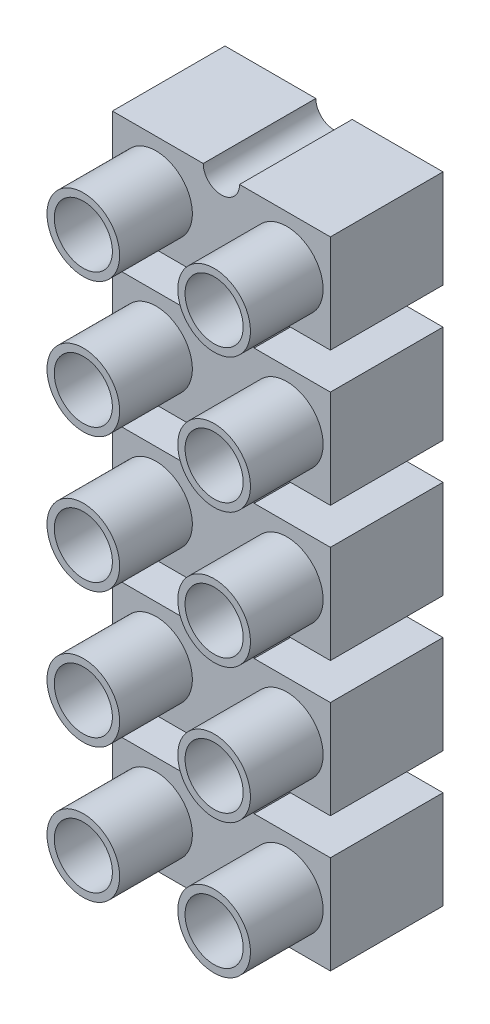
ISO-10303-21;
HEADER;
FILE_DESCRIPTION(('STEP AP214'),'2;1');
FILE_NAME('part.step','',(''),(''),'','','');
FILE_SCHEMA(('AUTOMOTIVE_DESIGN { 1 0 10303 214 1 1 1 1 }'));
ENDSEC;
DATA;
#1=APPLICATION_CONTEXT('core data for automotive mechanical design processes');
#2=APPLICATION_PROTOCOL_DEFINITION('international standard','automotive_design',2000,#1);
#3=PRODUCT_CONTEXT('',#1,'mechanical');
#4=PRODUCT('Part','Part','',(#3));
#5=PRODUCT_RELATED_PRODUCT_CATEGORY('part','',(#4));
#6=PRODUCT_DEFINITION_FORMATION('','',#4);
#7=PRODUCT_DEFINITION_CONTEXT('part definition',#1,'design');
#8=PRODUCT_DEFINITION('design','',#6,#7);
#9=PRODUCT_DEFINITION_SHAPE('','',#8);
#10=(LENGTH_UNIT() NAMED_UNIT(*) SI_UNIT(.MILLI.,.METRE.));
#11=(NAMED_UNIT(*) PLANE_ANGLE_UNIT() SI_UNIT($,.RADIAN.));
#12=(NAMED_UNIT(*) SI_UNIT($,.STERADIAN.) SOLID_ANGLE_UNIT());
#13=UNCERTAINTY_MEASURE_WITH_UNIT(LENGTH_MEASURE(1.E-05),#10,'distance_accuracy_value','');
#14=(GEOMETRIC_REPRESENTATION_CONTEXT(3) GLOBAL_UNCERTAINTY_ASSIGNED_CONTEXT((#13)) GLOBAL_UNIT_ASSIGNED_CONTEXT((#10,
#11,#12)) REPRESENTATION_CONTEXT('',''));
#15=CARTESIAN_POINT('',(0.,0.,0.));
#16=DIRECTION('',(0.,0.,1.));
#17=DIRECTION('',(1.,0.,0.));
#18=AXIS2_PLACEMENT_3D('',#15,#16,#17);
#19=CARTESIAN_POINT('',(-15.0041746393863,-14.7458253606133,7.75));
#20=DIRECTION('',(0.,0.,1.));
#21=DIRECTION('',(1.,0.,0.));
#22=AXIS2_PLACEMENT_3D('',#19,#20,#21);
#23=PLANE('',#22);
#24=CARTESIAN_POINT('',(-15.0041746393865,2.50417463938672,7.75));
#25=DIRECTION('',(0.,0.,1.));
#26=DIRECTION('',(1.,0.,0.));
#27=AXIS2_PLACEMENT_3D('',#24,#25,#26);
#28=CIRCLE('',#27,1.25);
#29=CARTESIAN_POINT('',(-13.7541746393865,2.50417463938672,7.75));
#30=VERTEX_POINT('',#29);
#31=EDGE_CURVE('E812',#30,#30,#28,.T.);
#32=ORIENTED_EDGE('',*,*,#31,.F.);
#33=EDGE_LOOP('',(#32));
#34=FACE_BOUND('',#33,.T.);
#35=CARTESIAN_POINT('',(-15.0041746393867,21.0041746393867,7.75));
#36=DIRECTION('',(0.,0.,1.));
#37=DIRECTION('',(1.,0.,0.));
#38=AXIS2_PLACEMENT_3D('',#35,#36,#37);
#39=CIRCLE('',#38,1.25);
#40=CARTESIAN_POINT('',(-13.7541746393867,21.0041746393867,7.75));
#41=VERTEX_POINT('',#40);
#42=EDGE_CURVE('E310',#41,#41,#39,.T.);
#43=ORIENTED_EDGE('',*,*,#42,.F.);
#44=EDGE_LOOP('',(#43));
#45=FACE_BOUND('',#44,.T.);
#46=DIRECTION('',(-1.,0.,0.));
#47=VECTOR('',#46,1.);
#48=CARTESIAN_POINT('',(-13.7541746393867,29.0041746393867,7.75));
#49=LINE('',#48,#47);
#50=CARTESIAN_POINT('',(-7.50417463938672,29.0041746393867,7.75));
#51=VERTEX_POINT('',#50);
#52=CARTESIAN_POINT('',(-13.7541746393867,29.0041746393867,7.75));
#53=VERTEX_POINT('',#52);
#54=EDGE_CURVE('E392',#51,#53,#49,.T.);
#55=ORIENTED_EDGE('',*,*,#54,.T.);
#56=CARTESIAN_POINT('',(-15.0041746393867,29.0041746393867,7.75));
#57=DIRECTION('',(0.,0.,-1.));
#58=DIRECTION('',(1.,0.,0.));
#59=AXIS2_PLACEMENT_3D('',#56,#57,#58);
#60=CIRCLE('',#59,1.25);
#61=CARTESIAN_POINT('',(-16.2541746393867,29.0041746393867,7.75));
#62=VERTEX_POINT('',#61);
#63=EDGE_CURVE('E302',#53,#62,#60,.T.);
#64=ORIENTED_EDGE('',*,*,#63,.T.);
#65=DIRECTION('',(-1.,0.,0.));
#66=VECTOR('',#65,1.);
#67=CARTESIAN_POINT('',(-22.5041746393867,29.0041746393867,7.75));
#68=LINE('',#67,#66);
#69=CARTESIAN_POINT('',(-22.5041746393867,29.0041746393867,7.75));
#70=VERTEX_POINT('',#69);
#71=EDGE_CURVE('E395',#62,#70,#68,.T.);
#72=ORIENTED_EDGE('',*,*,#71,.T.);
#73=DIRECTION('',(0.,-1.,0.));
#74=VECTOR('',#73,1.);
#75=CARTESIAN_POINT('',(-22.5041746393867,29.0041746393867,7.75));
#76=LINE('',#75,#74);
#77=CARTESIAN_POINT('',(-22.5041746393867,22.2541746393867,7.75));
#78=VERTEX_POINT('',#77);
#79=EDGE_CURVE('E397',#70,#78,#76,.T.);
#80=ORIENTED_EDGE('',*,*,#79,.T.);
#81=DIRECTION('',(1.,0.,0.));
#82=VECTOR('',#81,1.);
#83=CARTESIAN_POINT('',(-22.5041746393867,22.2541746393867,7.75));
#84=LINE('',#83,#82);
#85=CARTESIAN_POINT('',(-17.2541746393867,22.2541746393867,7.75));
#86=VERTEX_POINT('',#85);
#87=EDGE_CURVE('E399',#78,#86,#84,.T.);
#88=ORIENTED_EDGE('',*,*,#87,.T.);
#89=DIRECTION('',(0.,-1.,0.));
#90=VECTOR('',#89,1.);
#91=CARTESIAN_POINT('',(-17.2541746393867,22.2541746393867,7.75));
#92=LINE('',#91,#90);
#93=CARTESIAN_POINT('',(-17.2541746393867,19.7541746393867,7.75));
#94=VERTEX_POINT('',#93);
#95=EDGE_CURVE('E401',#86,#94,#92,.T.);
#96=ORIENTED_EDGE('',*,*,#95,.T.);
#97=DIRECTION('',(-1.,0.,0.));
#98=VECTOR('',#97,1.);
#99=CARTESIAN_POINT('',(-17.2541746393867,19.7541746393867,7.75));
#100=LINE('',#99,#98);
#101=CARTESIAN_POINT('',(-22.5041746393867,19.7541746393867,7.75));
#102=VERTEX_POINT('',#101);
#103=EDGE_CURVE('E403',#94,#102,#100,.T.);
#104=ORIENTED_EDGE('',*,*,#103,.T.);
#105=DIRECTION('',(0.,-1.,0.));
#106=VECTOR('',#105,1.);
#107=CARTESIAN_POINT('',(-22.5041746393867,19.7541746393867,7.75));
#108=LINE('',#107,#106);
#109=CARTESIAN_POINT('',(-22.5041746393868,13.0041746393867,7.75));
#110=VERTEX_POINT('',#109);
#111=EDGE_CURVE('E405',#102,#110,#108,.T.);
#112=ORIENTED_EDGE('',*,*,#111,.T.);
#113=DIRECTION('',(1.,0.,0.));
#114=VECTOR('',#113,1.);
#115=CARTESIAN_POINT('',(-22.5041746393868,13.0041746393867,7.75));
#116=LINE('',#115,#114);
#117=CARTESIAN_POINT('',(-17.2541746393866,13.0041746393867,7.75));
#118=VERTEX_POINT('',#117);
#119=EDGE_CURVE('E407',#110,#118,#116,.T.);
#120=ORIENTED_EDGE('',*,*,#119,.T.);
#121=DIRECTION('',(0.,-1.,0.));
#122=VECTOR('',#121,1.);
#123=CARTESIAN_POINT('',(-17.2541746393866,13.0041746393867,7.75));
#124=LINE('',#123,#122);
#125=CARTESIAN_POINT('',(-17.2541746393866,10.5041746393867,7.75));
#126=VERTEX_POINT('',#125);
#127=EDGE_CURVE('E409',#118,#126,#124,.T.);
#128=ORIENTED_EDGE('',*,*,#127,.T.);
#129=DIRECTION('',(-1.,0.,0.));
#130=VECTOR('',#129,1.);
#131=CARTESIAN_POINT('',(-17.2541746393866,10.5041746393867,7.75));
#132=LINE('',#131,#130);
#133=CARTESIAN_POINT('',(-22.5041746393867,10.5041746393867,7.75));
#134=VERTEX_POINT('',#133);
#135=EDGE_CURVE('E411',#126,#134,#132,.T.);
#136=ORIENTED_EDGE('',*,*,#135,.T.);
#137=DIRECTION('',(0.,-1.,0.));
#138=VECTOR('',#137,1.);
#139=CARTESIAN_POINT('',(-22.5041746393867,10.5041746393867,7.75));
#140=LINE('',#139,#138);
#141=CARTESIAN_POINT('',(-22.5041746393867,3.75417463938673,7.75));
#142=VERTEX_POINT('',#141);
#143=EDGE_CURVE('E413',#134,#142,#140,.T.);
#144=ORIENTED_EDGE('',*,*,#143,.T.);
#145=DIRECTION('',(1.,0.,0.));
#146=VECTOR('',#145,1.);
#147=CARTESIAN_POINT('',(-22.5041746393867,3.75417463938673,7.75));
#148=LINE('',#147,#146);
#149=CARTESIAN_POINT('',(-17.2541746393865,3.75417463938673,7.75));
#150=VERTEX_POINT('',#149);
#151=EDGE_CURVE('E415',#142,#150,#148,.T.);
#152=ORIENTED_EDGE('',*,*,#151,.T.);
#153=DIRECTION('',(0.,-1.,0.));
#154=VECTOR('',#153,1.);
#155=CARTESIAN_POINT('',(-17.2541746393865,3.75417463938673,7.75));
#156=LINE('',#155,#154);
#157=CARTESIAN_POINT('',(-17.2541746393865,1.25417463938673,7.75));
#158=VERTEX_POINT('',#157);
#159=EDGE_CURVE('E417',#150,#158,#156,.T.);
#160=ORIENTED_EDGE('',*,*,#159,.T.);
#161=DIRECTION('',(-1.,0.,0.));
#162=VECTOR('',#161,1.);
#163=CARTESIAN_POINT('',(-17.2541746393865,1.25417463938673,7.75));
#164=LINE('',#163,#162);
#165=CARTESIAN_POINT('',(-22.5041746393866,1.25417463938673,7.75));
#166=VERTEX_POINT('',#165);
#167=EDGE_CURVE('E419',#158,#166,#164,.T.);
#168=ORIENTED_EDGE('',*,*,#167,.T.);
#169=DIRECTION('',(0.,-1.,0.));
#170=VECTOR('',#169,1.);
#171=CARTESIAN_POINT('',(-22.5041746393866,1.25417463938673,7.75));
#172=LINE('',#171,#170);
#173=CARTESIAN_POINT('',(-22.5041746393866,-5.49582536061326,7.75));
#174=VERTEX_POINT('',#173);
#175=EDGE_CURVE('E421',#166,#174,#172,.T.);
#176=ORIENTED_EDGE('',*,*,#175,.T.);
#177=DIRECTION('',(1.,0.,0.));
#178=VECTOR('',#177,1.);
#179=CARTESIAN_POINT('',(-22.5041746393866,-5.49582536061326,7.75));
#180=LINE('',#179,#178);
#181=CARTESIAN_POINT('',(-17.2541746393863,-5.49582536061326,7.75));
#182=VERTEX_POINT('',#181);
#183=EDGE_CURVE('E423',#174,#182,#180,.T.);
#184=ORIENTED_EDGE('',*,*,#183,.T.);
#185=DIRECTION('',(0.,-1.,0.));
#186=VECTOR('',#185,1.);
#187=CARTESIAN_POINT('',(-17.2541746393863,-5.49582536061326,7.75));
#188=LINE('',#187,#186);
#189=CARTESIAN_POINT('',(-17.2541746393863,-7.99582536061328,7.75));
#190=VERTEX_POINT('',#189);
#191=EDGE_CURVE('E425',#182,#190,#188,.T.);
#192=ORIENTED_EDGE('',*,*,#191,.T.);
#193=DIRECTION('',(-1.,0.,0.));
#194=VECTOR('',#193,1.);
#195=CARTESIAN_POINT('',(-17.2541746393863,-7.99582536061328,7.75));
#196=LINE('',#195,#194);
#197=CARTESIAN_POINT('',(-22.5041746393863,-7.99582536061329,7.75));
#198=VERTEX_POINT('',#197);
#199=EDGE_CURVE('E427',#190,#198,#196,.T.);
#200=ORIENTED_EDGE('',*,*,#199,.T.);
#201=DIRECTION('',(0.,-1.,0.));
#202=VECTOR('',#201,1.);
#203=CARTESIAN_POINT('',(-22.5041746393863,-7.99582536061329,7.75));
#204=LINE('',#203,#202);
#205=CARTESIAN_POINT('',(-22.5041746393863,-14.7458253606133,7.75));
#206=VERTEX_POINT('',#205);
#207=EDGE_CURVE('E429',#198,#206,#204,.T.);
#208=ORIENTED_EDGE('',*,*,#207,.T.);
#209=DIRECTION('',(1.,0.,0.));
#210=VECTOR('',#209,1.);
#211=CARTESIAN_POINT('',(-16.2541746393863,-14.7458253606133,7.75));
#212=LINE('',#211,#210);
#213=CARTESIAN_POINT('',(-16.2541746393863,-14.7458253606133,7.75));
#214=VERTEX_POINT('',#213);
#215=EDGE_CURVE('E431',#206,#214,#212,.T.);
#216=ORIENTED_EDGE('',*,*,#215,.T.);
#217=CARTESIAN_POINT('',(-15.0041746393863,-14.7458253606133,7.75));
#218=DIRECTION('',(0.,0.,-1.));
#219=DIRECTION('',(1.,0.,0.));
#220=AXIS2_PLACEMENT_3D('',#217,#218,#219);
#221=CIRCLE('',#220,1.25);
#222=CARTESIAN_POINT('',(-13.7541746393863,-14.7458253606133,7.75));
#223=VERTEX_POINT('',#222);
#224=EDGE_CURVE('E433',#214,#223,#221,.T.);
#225=ORIENTED_EDGE('',*,*,#224,.T.);
#226=DIRECTION('',(1.,0.,0.));
#227=VECTOR('',#226,1.);
#228=CARTESIAN_POINT('',(-7.50417463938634,-14.7458253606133,7.75));
#229=LINE('',#228,#227);
#230=CARTESIAN_POINT('',(-7.50417463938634,-14.7458253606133,7.75));
#231=VERTEX_POINT('',#230);
#232=EDGE_CURVE('E435',#223,#231,#229,.T.);
#233=ORIENTED_EDGE('',*,*,#232,.T.);
#234=DIRECTION('',(0.,1.,0.));
#235=VECTOR('',#234,1.);
#236=CARTESIAN_POINT('',(-7.50417463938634,-7.99582536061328,7.75));
#237=LINE('',#236,#235);
#238=CARTESIAN_POINT('',(-7.50417463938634,-7.99582536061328,7.75));
#239=VERTEX_POINT('',#238);
#240=EDGE_CURVE('E437',#231,#239,#237,.T.);
#241=ORIENTED_EDGE('',*,*,#240,.T.);
#242=DIRECTION('',(-1.,0.,0.));
#243=VECTOR('',#242,1.);
#244=CARTESIAN_POINT('',(-12.7541746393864,-7.99582536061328,7.75));
#245=LINE('',#244,#243);
#246=CARTESIAN_POINT('',(-12.7541746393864,-7.99582536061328,7.75));
#247=VERTEX_POINT('',#246);
#248=EDGE_CURVE('E439',#239,#247,#245,.T.);
#249=ORIENTED_EDGE('',*,*,#248,.T.);
#250=DIRECTION('',(0.,1.,0.));
#251=VECTOR('',#250,1.);
#252=CARTESIAN_POINT('',(-12.7541746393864,-5.49582536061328,7.75));
#253=LINE('',#252,#251);
#254=CARTESIAN_POINT('',(-12.7541746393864,-5.49582536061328,7.75));
#255=VERTEX_POINT('',#254);
#256=EDGE_CURVE('E441',#247,#255,#253,.T.);
#257=ORIENTED_EDGE('',*,*,#256,.T.);
#258=DIRECTION('',(1.,0.,0.));
#259=VECTOR('',#258,1.);
#260=CARTESIAN_POINT('',(-7.50417463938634,-5.49582536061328,7.75));
#261=LINE('',#260,#259);
#262=CARTESIAN_POINT('',(-7.50417463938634,-5.49582536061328,7.75));
#263=VERTEX_POINT('',#262);
#264=EDGE_CURVE('E443',#255,#263,#261,.T.);
#265=ORIENTED_EDGE('',*,*,#264,.T.);
#266=DIRECTION('',(0.,1.,0.));
#267=VECTOR('',#266,1.);
#268=CARTESIAN_POINT('',(-7.50417463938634,1.25417463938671,7.75));
#269=LINE('',#268,#267);
#270=CARTESIAN_POINT('',(-7.50417463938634,1.25417463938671,7.75));
#271=VERTEX_POINT('',#270);
#272=EDGE_CURVE('E445',#263,#271,#269,.T.);
#273=ORIENTED_EDGE('',*,*,#272,.T.);
#274=DIRECTION('',(-1.,0.,0.));
#275=VECTOR('',#274,1.);
#276=CARTESIAN_POINT('',(-12.7541746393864,1.25417463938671,7.75));
#277=LINE('',#276,#275);
#278=CARTESIAN_POINT('',(-12.7541746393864,1.25417463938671,7.75));
#279=VERTEX_POINT('',#278);
#280=EDGE_CURVE('E447',#271,#279,#277,.T.);
#281=ORIENTED_EDGE('',*,*,#280,.T.);
#282=DIRECTION('',(0.,1.,0.));
#283=VECTOR('',#282,1.);
#284=CARTESIAN_POINT('',(-12.7541746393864,3.75417463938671,7.75));
#285=LINE('',#284,#283);
#286=CARTESIAN_POINT('',(-12.7541746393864,3.75417463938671,7.75));
#287=VERTEX_POINT('',#286);
#288=EDGE_CURVE('E449',#279,#287,#285,.T.);
#289=ORIENTED_EDGE('',*,*,#288,.T.);
#290=DIRECTION('',(1.,0.,0.));
#291=VECTOR('',#290,1.);
#292=CARTESIAN_POINT('',(-7.50417463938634,3.75417463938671,7.75));
#293=LINE('',#292,#291);
#294=CARTESIAN_POINT('',(-7.50417463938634,3.75417463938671,7.75));
#295=VERTEX_POINT('',#294);
#296=EDGE_CURVE('E451',#287,#295,#293,.T.);
#297=ORIENTED_EDGE('',*,*,#296,.T.);
#298=DIRECTION('',(0.,1.,0.));
#299=VECTOR('',#298,1.);
#300=CARTESIAN_POINT('',(-7.50417463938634,10.5041746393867,7.75));
#301=LINE('',#300,#299);
#302=CARTESIAN_POINT('',(-7.50417463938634,10.5041746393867,7.75));
#303=VERTEX_POINT('',#302);
#304=EDGE_CURVE('E453',#295,#303,#301,.T.);
#305=ORIENTED_EDGE('',*,*,#304,.T.);
#306=DIRECTION('',(-1.,0.,0.));
#307=VECTOR('',#306,1.);
#308=CARTESIAN_POINT('',(-12.7541746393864,10.5041746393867,7.75));
#309=LINE('',#308,#307);
#310=CARTESIAN_POINT('',(-12.7541746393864,10.5041746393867,7.75));
#311=VERTEX_POINT('',#310);
#312=EDGE_CURVE('E455',#303,#311,#309,.T.);
#313=ORIENTED_EDGE('',*,*,#312,.T.);
#314=DIRECTION('',(0.,1.,0.));
#315=VECTOR('',#314,1.);
#316=CARTESIAN_POINT('',(-12.7541746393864,13.0041746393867,7.75));
#317=LINE('',#316,#315);
#318=CARTESIAN_POINT('',(-12.7541746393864,13.0041746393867,7.75));
#319=VERTEX_POINT('',#318);
#320=EDGE_CURVE('E457',#311,#319,#317,.T.);
#321=ORIENTED_EDGE('',*,*,#320,.T.);
#322=DIRECTION('',(1.,0.,0.));
#323=VECTOR('',#322,1.);
#324=CARTESIAN_POINT('',(-7.50417463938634,13.0041746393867,7.75));
#325=LINE('',#324,#323);
#326=CARTESIAN_POINT('',(-7.50417463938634,13.0041746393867,7.75));
#327=VERTEX_POINT('',#326);
#328=EDGE_CURVE('E459',#319,#327,#325,.T.);
#329=ORIENTED_EDGE('',*,*,#328,.T.);
#330=DIRECTION('',(0.,1.,0.));
#331=VECTOR('',#330,1.);
#332=CARTESIAN_POINT('',(-7.50417463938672,19.7541746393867,7.75));
#333=LINE('',#332,#331);
#334=CARTESIAN_POINT('',(-7.50417463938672,19.7541746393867,7.75));
#335=VERTEX_POINT('',#334);
#336=EDGE_CURVE('E461',#327,#335,#333,.T.);
#337=ORIENTED_EDGE('',*,*,#336,.T.);
#338=DIRECTION('',(-1.,0.,0.));
#339=VECTOR('',#338,1.);
#340=CARTESIAN_POINT('',(-12.7541746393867,19.7541746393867,7.75));
#341=LINE('',#340,#339);
#342=CARTESIAN_POINT('',(-12.7541746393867,19.7541746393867,7.75));
#343=VERTEX_POINT('',#342);
#344=EDGE_CURVE('E463',#335,#343,#341,.T.);
#345=ORIENTED_EDGE('',*,*,#344,.T.);
#346=DIRECTION('',(0.,1.,0.));
#347=VECTOR('',#346,1.);
#348=CARTESIAN_POINT('',(-12.7541746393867,22.2541746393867,7.75));
#349=LINE('',#348,#347);
#350=CARTESIAN_POINT('',(-12.7541746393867,22.2541746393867,7.75));
#351=VERTEX_POINT('',#350);
#352=EDGE_CURVE('E465',#343,#351,#349,.T.);
#353=ORIENTED_EDGE('',*,*,#352,.T.);
#354=DIRECTION('',(1.,0.,0.));
#355=VECTOR('',#354,1.);
#356=CARTESIAN_POINT('',(-7.50417463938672,22.2541746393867,7.75));
#357=LINE('',#356,#355);
#358=CARTESIAN_POINT('',(-7.50417463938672,22.2541746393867,7.75));
#359=VERTEX_POINT('',#358);
#360=EDGE_CURVE('E49',#351,#359,#357,.T.);
#361=ORIENTED_EDGE('',*,*,#360,.T.);
#362=DIRECTION('',(0.,1.,0.));
#363=VECTOR('',#362,1.);
#364=CARTESIAN_POINT('',(-7.50417463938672,29.0041746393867,7.75));
#365=LINE('',#364,#363);
#366=EDGE_CURVE('E44',#359,#51,#365,.T.);
#367=ORIENTED_EDGE('',*,*,#366,.T.);
#368=EDGE_LOOP('',(#55,#64,#72,#80,#88,#96,#104,#112,#120,#128,#136,#144,#152,#160,#168,#176,
#184,#192,#200,#208,#216,#225,#233,#241,#249,#257,#265,#273,#281,#289,#297,#305,#313,#321,#329,
#337,#345,#353,#361,#367));
#369=FACE_BOUND('',#368,.T.);
#370=CARTESIAN_POINT('',(-15.0041746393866,11.7541746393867,7.75));
#371=DIRECTION('',(0.,0.,1.));
#372=DIRECTION('',(1.,0.,0.));
#373=AXIS2_PLACEMENT_3D('',#370,#371,#372);
#374=CIRCLE('',#373,1.25);
#375=CARTESIAN_POINT('',(-13.7541746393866,11.7541746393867,7.75));
#376=VERTEX_POINT('',#375);
#377=EDGE_CURVE('E805',#376,#376,#374,.T.);
#378=ORIENTED_EDGE('',*,*,#377,.F.);
#379=EDGE_LOOP('',(#378));
#380=FACE_BOUND('',#379,.T.);
#381=CARTESIAN_POINT('',(-15.0041746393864,-6.74582536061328,7.75));
#382=DIRECTION('',(0.,0.,1.));
#383=DIRECTION('',(1.,0.,0.));
#384=AXIS2_PLACEMENT_3D('',#381,#382,#383);
#385=CIRCLE('',#384,1.25);
#386=CARTESIAN_POINT('',(-13.7541746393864,-6.74582536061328,7.75));
#387=VERTEX_POINT('',#386);
#388=EDGE_CURVE('E818',#387,#387,#385,.T.);
#389=ORIENTED_EDGE('',*,*,#388,.F.);
#390=EDGE_LOOP('',(#389));
#391=FACE_BOUND('',#390,.T.);
#392=CARTESIAN_POINT('',(-10.5041746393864,25.6341746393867,7.75));
#393=DIRECTION('',(0.,0.,1.));
#394=DIRECTION('',(1.,0.,0.));
#395=AXIS2_PLACEMENT_3D('',#392,#393,#394);
#396=CIRCLE('',#395,2.5);
#397=CARTESIAN_POINT('',(-8.00417463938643,25.6341746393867,7.75));
#398=VERTEX_POINT('',#397);
#399=EDGE_CURVE('E827',#398,#398,#396,.T.);
#400=ORIENTED_EDGE('',*,*,#399,.F.);
#401=EDGE_LOOP('',(#400));
#402=FACE_BOUND('',#401,.T.);
#403=CARTESIAN_POINT('',(-19.5041746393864,25.6341746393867,7.75));
#404=DIRECTION('',(0.,0.,1.));
#405=DIRECTION('',(-1.,0.,0.));
#406=AXIS2_PLACEMENT_3D('',#403,#404,#405);
#407=CIRCLE('',#406,2.5);
#408=CARTESIAN_POINT('',(-22.0041746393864,25.6341746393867,7.75));
#409=VERTEX_POINT('',#408);
#410=EDGE_CURVE('E836',#409,#409,#407,.T.);
#411=ORIENTED_EDGE('',*,*,#410,.F.);
#412=EDGE_LOOP('',(#411));
#413=FACE_BOUND('',#412,.T.);
#414=CARTESIAN_POINT('',(-10.5041746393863,16.3841746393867,7.75));
#415=DIRECTION('',(0.,0.,1.));
#416=DIRECTION('',(1.,0.,0.));
#417=AXIS2_PLACEMENT_3D('',#414,#415,#416);
#418=CIRCLE('',#417,2.5);
#419=CARTESIAN_POINT('',(-8.00417463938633,16.3841746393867,7.75));
#420=VERTEX_POINT('',#419);
#421=EDGE_CURVE('E845',#420,#420,#418,.T.);
#422=ORIENTED_EDGE('',*,*,#421,.F.);
#423=EDGE_LOOP('',(#422));
#424=FACE_BOUND('',#423,.T.);
#425=CARTESIAN_POINT('',(-19.5041746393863,16.3841746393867,7.75));
#426=DIRECTION('',(0.,0.,1.));
#427=DIRECTION('',(-1.,0.,0.));
#428=AXIS2_PLACEMENT_3D('',#425,#426,#427);
#429=CIRCLE('',#428,2.5);
#430=CARTESIAN_POINT('',(-22.0041746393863,16.3841746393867,7.75));
#431=VERTEX_POINT('',#430);
#432=EDGE_CURVE('E854',#431,#431,#429,.T.);
#433=ORIENTED_EDGE('',*,*,#432,.F.);
#434=EDGE_LOOP('',(#433));
#435=FACE_BOUND('',#434,.T.);
#436=CARTESIAN_POINT('',(-10.5041746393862,7.13417463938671,7.75));
#437=DIRECTION('',(0.,0.,1.));
#438=DIRECTION('',(1.,0.,0.));
#439=AXIS2_PLACEMENT_3D('',#436,#437,#438);
#440=CIRCLE('',#439,2.5);
#441=CARTESIAN_POINT('',(-8.00417463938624,7.13417463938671,7.75));
#442=VERTEX_POINT('',#441);
#443=EDGE_CURVE('E863',#442,#442,#440,.T.);
#444=ORIENTED_EDGE('',*,*,#443,.F.);
#445=EDGE_LOOP('',(#444));
#446=FACE_BOUND('',#445,.T.);
#447=CARTESIAN_POINT('',(-19.5041746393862,7.13417463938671,7.75));
#448=DIRECTION('',(0.,0.,1.));
#449=DIRECTION('',(-1.,0.,0.));
#450=AXIS2_PLACEMENT_3D('',#447,#448,#449);
#451=CIRCLE('',#450,2.5);
#452=CARTESIAN_POINT('',(-22.0041746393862,7.13417463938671,7.75));
#453=VERTEX_POINT('',#452);
#454=EDGE_CURVE('E872',#453,#453,#451,.T.);
#455=ORIENTED_EDGE('',*,*,#454,.F.);
#456=EDGE_LOOP('',(#455));
#457=FACE_BOUND('',#456,.T.);
#458=CARTESIAN_POINT('',(-10.5041746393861,-2.11582536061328,7.75));
#459=DIRECTION('',(0.,0.,1.));
#460=DIRECTION('',(1.,0.,0.));
#461=AXIS2_PLACEMENT_3D('',#458,#459,#460);
#462=CIRCLE('',#461,2.5);
#463=CARTESIAN_POINT('',(-8.00417463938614,-2.11582536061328,7.75));
#464=VERTEX_POINT('',#463);
#465=EDGE_CURVE('E881',#464,#464,#462,.T.);
#466=ORIENTED_EDGE('',*,*,#465,.F.);
#467=EDGE_LOOP('',(#466));
#468=FACE_BOUND('',#467,.T.);
#469=CARTESIAN_POINT('',(-19.5041746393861,-2.11582536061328,7.75));
#470=DIRECTION('',(0.,0.,1.));
#471=DIRECTION('',(-1.,0.,0.));
#472=AXIS2_PLACEMENT_3D('',#469,#470,#471);
#473=CIRCLE('',#472,2.5);
#474=CARTESIAN_POINT('',(-22.0041746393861,-2.11582536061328,7.75));
#475=VERTEX_POINT('',#474);
#476=EDGE_CURVE('E889',#475,#475,#473,.T.);
#477=ORIENTED_EDGE('',*,*,#476,.F.);
#478=EDGE_LOOP('',(#477));
#479=FACE_BOUND('',#478,.T.);
#480=CARTESIAN_POINT('',(-10.504174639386,-11.3658253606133,7.75));
#481=DIRECTION('',(0.,0.,1.));
#482=DIRECTION('',(1.,0.,0.));
#483=AXIS2_PLACEMENT_3D('',#480,#481,#482);
#484=CIRCLE('',#483,2.5);
#485=CARTESIAN_POINT('',(-8.00417463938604,-11.3658253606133,7.75));
#486=VERTEX_POINT('',#485);
#487=EDGE_CURVE('E898',#486,#486,#484,.T.);
#488=ORIENTED_EDGE('',*,*,#487,.F.);
#489=EDGE_LOOP('',(#488));
#490=FACE_BOUND('',#489,.T.);
#491=CARTESIAN_POINT('',(-19.504174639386,-11.3658253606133,7.75));
#492=DIRECTION('',(0.,0.,1.));
#493=DIRECTION('',(-1.,0.,0.));
#494=AXIS2_PLACEMENT_3D('',#491,#492,#493);
#495=CIRCLE('',#494,2.5);
#496=CARTESIAN_POINT('',(-22.004174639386,-11.3658253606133,7.75));
#497=VERTEX_POINT('',#496);
#498=EDGE_CURVE('E907',#497,#497,#495,.T.);
#499=ORIENTED_EDGE('',*,*,#498,.F.);
#500=EDGE_LOOP('',(#499));
#501=FACE_BOUND('',#500,.T.);
#502=ADVANCED_FACE('F29',(#34,#45,#369,#380,#391,#402,#413,#424,#435,#446,#457,#468,#479,#490,
#501),#23,.T.);
#503=CARTESIAN_POINT('',(-15.0041746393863,-14.7458253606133,0.));
#504=DIRECTION('',(0.,0.,1.));
#505=DIRECTION('',(1.,0.,0.));
#506=AXIS2_PLACEMENT_3D('',#503,#504,#505);
#507=PLANE('',#506);
#508=CARTESIAN_POINT('',(-15.0041746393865,2.50417463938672,0.));
#509=DIRECTION('',(0.,0.,1.));
#510=DIRECTION('',(1.,0.,0.));
#511=AXIS2_PLACEMENT_3D('',#508,#509,#510);
#512=CIRCLE('',#511,1.25);
#513=CARTESIAN_POINT('',(-13.7541746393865,2.50417463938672,0.));
#514=VERTEX_POINT('',#513);
#515=EDGE_CURVE('E815',#514,#514,#512,.T.);
#516=ORIENTED_EDGE('',*,*,#515,.T.);
#517=EDGE_LOOP('',(#516));
#518=FACE_BOUND('',#517,.T.);
#519=CARTESIAN_POINT('',(-15.0041746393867,21.0041746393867,0.));
#520=DIRECTION('',(0.,0.,1.));
#521=DIRECTION('',(1.,0.,0.));
#522=AXIS2_PLACEMENT_3D('',#519,#520,#521);
#523=CIRCLE('',#522,1.25);
#524=CARTESIAN_POINT('',(-13.7541746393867,21.0041746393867,0.));
#525=VERTEX_POINT('',#524);
#526=EDGE_CURVE('E313',#525,#525,#523,.T.);
#527=ORIENTED_EDGE('',*,*,#526,.T.);
#528=EDGE_LOOP('',(#527));
#529=FACE_BOUND('',#528,.T.);
#530=DIRECTION('',(-1.,0.,0.));
#531=VECTOR('',#530,1.);
#532=CARTESIAN_POINT('',(-13.7541746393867,29.0041746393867,0.));
#533=LINE('',#532,#531);
#534=CARTESIAN_POINT('',(-7.50417463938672,29.0041746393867,0.));
#535=VERTEX_POINT('',#534);
#536=CARTESIAN_POINT('',(-13.7541746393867,29.0041746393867,0.));
#537=VERTEX_POINT('',#536);
#538=EDGE_CURVE('E292',#535,#537,#533,.T.);
#539=ORIENTED_EDGE('',*,*,#538,.F.);
#540=DIRECTION('',(0.,1.,0.));
#541=VECTOR('',#540,1.);
#542=CARTESIAN_POINT('',(-7.50417463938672,29.0041746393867,0.));
#543=LINE('',#542,#541);
#544=CARTESIAN_POINT('',(-7.50417463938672,22.2541746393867,0.));
#545=VERTEX_POINT('',#544);
#546=EDGE_CURVE('E390',#545,#535,#543,.T.);
#547=ORIENTED_EDGE('',*,*,#546,.F.);
#548=DIRECTION('',(1.,0.,0.));
#549=VECTOR('',#548,1.);
#550=CARTESIAN_POINT('',(-7.50417463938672,22.2541746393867,0.));
#551=LINE('',#550,#549);
#552=CARTESIAN_POINT('',(-12.7541746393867,22.2541746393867,0.));
#553=VERTEX_POINT('',#552);
#554=EDGE_CURVE('E388',#553,#545,#551,.T.);
#555=ORIENTED_EDGE('',*,*,#554,.F.);
#556=DIRECTION('',(0.,1.,0.));
#557=VECTOR('',#556,1.);
#558=CARTESIAN_POINT('',(-12.7541746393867,22.2541746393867,0.));
#559=LINE('',#558,#557);
#560=CARTESIAN_POINT('',(-12.7541746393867,19.7541746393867,0.));
#561=VERTEX_POINT('',#560);
#562=EDGE_CURVE('E386',#561,#553,#559,.T.);
#563=ORIENTED_EDGE('',*,*,#562,.F.);
#564=DIRECTION('',(-1.,0.,0.));
#565=VECTOR('',#564,1.);
#566=CARTESIAN_POINT('',(-12.7541746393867,19.7541746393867,0.));
#567=LINE('',#566,#565);
#568=CARTESIAN_POINT('',(-7.50417463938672,19.7541746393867,0.));
#569=VERTEX_POINT('',#568);
#570=EDGE_CURVE('E384',#569,#561,#567,.T.);
#571=ORIENTED_EDGE('',*,*,#570,.F.);
#572=DIRECTION('',(0.,1.,0.));
#573=VECTOR('',#572,1.);
#574=CARTESIAN_POINT('',(-7.50417463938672,19.7541746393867,0.));
#575=LINE('',#574,#573);
#576=CARTESIAN_POINT('',(-7.50417463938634,13.0041746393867,0.));
#577=VERTEX_POINT('',#576);
#578=EDGE_CURVE('E382',#577,#569,#575,.T.);
#579=ORIENTED_EDGE('',*,*,#578,.F.);
#580=DIRECTION('',(1.,0.,0.));
#581=VECTOR('',#580,1.);
#582=CARTESIAN_POINT('',(-7.50417463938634,13.0041746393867,0.));
#583=LINE('',#582,#581);
#584=CARTESIAN_POINT('',(-12.7541746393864,13.0041746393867,0.));
#585=VERTEX_POINT('',#584);
#586=EDGE_CURVE('E380',#585,#577,#583,.T.);
#587=ORIENTED_EDGE('',*,*,#586,.F.);
#588=DIRECTION('',(0.,1.,0.));
#589=VECTOR('',#588,1.);
#590=CARTESIAN_POINT('',(-12.7541746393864,13.0041746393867,0.));
#591=LINE('',#590,#589);
#592=CARTESIAN_POINT('',(-12.7541746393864,10.5041746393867,0.));
#593=VERTEX_POINT('',#592);
#594=EDGE_CURVE('E378',#593,#585,#591,.T.);
#595=ORIENTED_EDGE('',*,*,#594,.F.);
#596=DIRECTION('',(-1.,0.,0.));
#597=VECTOR('',#596,1.);
#598=CARTESIAN_POINT('',(-12.7541746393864,10.5041746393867,0.));
#599=LINE('',#598,#597);
#600=CARTESIAN_POINT('',(-7.50417463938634,10.5041746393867,0.));
#601=VERTEX_POINT('',#600);
#602=EDGE_CURVE('E376',#601,#593,#599,.T.);
#603=ORIENTED_EDGE('',*,*,#602,.F.);
#604=DIRECTION('',(0.,1.,0.));
#605=VECTOR('',#604,1.);
#606=CARTESIAN_POINT('',(-7.50417463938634,10.5041746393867,0.));
#607=LINE('',#606,#605);
#608=CARTESIAN_POINT('',(-7.50417463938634,3.75417463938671,0.));
#609=VERTEX_POINT('',#608);
#610=EDGE_CURVE('E374',#609,#601,#607,.T.);
#611=ORIENTED_EDGE('',*,*,#610,.F.);
#612=DIRECTION('',(1.,0.,0.));
#613=VECTOR('',#612,1.);
#614=CARTESIAN_POINT('',(-7.50417463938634,3.75417463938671,0.));
#615=LINE('',#614,#613);
#616=CARTESIAN_POINT('',(-12.7541746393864,3.75417463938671,0.));
#617=VERTEX_POINT('',#616);
#618=EDGE_CURVE('E372',#617,#609,#615,.T.);
#619=ORIENTED_EDGE('',*,*,#618,.F.);
#620=DIRECTION('',(0.,1.,0.));
#621=VECTOR('',#620,1.);
#622=CARTESIAN_POINT('',(-12.7541746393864,3.75417463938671,0.));
#623=LINE('',#622,#621);
#624=CARTESIAN_POINT('',(-12.7541746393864,1.25417463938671,0.));
#625=VERTEX_POINT('',#624);
#626=EDGE_CURVE('E370',#625,#617,#623,.T.);
#627=ORIENTED_EDGE('',*,*,#626,.F.);
#628=DIRECTION('',(-1.,0.,0.));
#629=VECTOR('',#628,1.);
#630=CARTESIAN_POINT('',(-12.7541746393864,1.25417463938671,0.));
#631=LINE('',#630,#629);
#632=CARTESIAN_POINT('',(-7.50417463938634,1.25417463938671,0.));
#633=VERTEX_POINT('',#632);
#634=EDGE_CURVE('E368',#633,#625,#631,.T.);
#635=ORIENTED_EDGE('',*,*,#634,.F.);
#636=DIRECTION('',(0.,1.,0.));
#637=VECTOR('',#636,1.);
#638=CARTESIAN_POINT('',(-7.50417463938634,1.25417463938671,0.));
#639=LINE('',#638,#637);
#640=CARTESIAN_POINT('',(-7.50417463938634,-5.49582536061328,0.));
#641=VERTEX_POINT('',#640);
#642=EDGE_CURVE('E366',#641,#633,#639,.T.);
#643=ORIENTED_EDGE('',*,*,#642,.F.);
#644=DIRECTION('',(1.,0.,0.));
#645=VECTOR('',#644,1.);
#646=CARTESIAN_POINT('',(-7.50417463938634,-5.49582536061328,0.));
#647=LINE('',#646,#645);
#648=CARTESIAN_POINT('',(-12.7541746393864,-5.49582536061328,0.));
#649=VERTEX_POINT('',#648);
#650=EDGE_CURVE('E364',#649,#641,#647,.T.);
#651=ORIENTED_EDGE('',*,*,#650,.F.);
#652=DIRECTION('',(0.,1.,0.));
#653=VECTOR('',#652,1.);
#654=CARTESIAN_POINT('',(-12.7541746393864,-5.49582536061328,0.));
#655=LINE('',#654,#653);
#656=CARTESIAN_POINT('',(-12.7541746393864,-7.99582536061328,0.));
#657=VERTEX_POINT('',#656);
#658=EDGE_CURVE('E362',#657,#649,#655,.T.);
#659=ORIENTED_EDGE('',*,*,#658,.F.);
#660=DIRECTION('',(-1.,0.,0.));
#661=VECTOR('',#660,1.);
#662=CARTESIAN_POINT('',(-12.7541746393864,-7.99582536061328,0.));
#663=LINE('',#662,#661);
#664=CARTESIAN_POINT('',(-7.50417463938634,-7.99582536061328,0.));
#665=VERTEX_POINT('',#664);
#666=EDGE_CURVE('E360',#665,#657,#663,.T.);
#667=ORIENTED_EDGE('',*,*,#666,.F.);
#668=DIRECTION('',(0.,1.,0.));
#669=VECTOR('',#668,1.);
#670=CARTESIAN_POINT('',(-7.50417463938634,-7.99582536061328,0.));
#671=LINE('',#670,#669);
#672=CARTESIAN_POINT('',(-7.50417463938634,-14.7458253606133,0.));
#673=VERTEX_POINT('',#672);
#674=EDGE_CURVE('E358',#673,#665,#671,.T.);
#675=ORIENTED_EDGE('',*,*,#674,.F.);
#676=DIRECTION('',(1.,0.,0.));
#677=VECTOR('',#676,1.);
#678=CARTESIAN_POINT('',(-7.50417463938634,-14.7458253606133,0.));
#679=LINE('',#678,#677);
#680=CARTESIAN_POINT('',(-13.7541746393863,-14.7458253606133,0.));
#681=VERTEX_POINT('',#680);
#682=EDGE_CURVE('E356',#681,#673,#679,.T.);
#683=ORIENTED_EDGE('',*,*,#682,.F.);
#684=CARTESIAN_POINT('',(-15.0041746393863,-14.7458253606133,0.));
#685=DIRECTION('',(0.,0.,-1.));
#686=DIRECTION('',(1.,0.,0.));
#687=AXIS2_PLACEMENT_3D('',#684,#685,#686);
#688=CIRCLE('',#687,1.25);
#689=CARTESIAN_POINT('',(-16.2541746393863,-14.7458253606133,0.));
#690=VERTEX_POINT('',#689);
#691=EDGE_CURVE('E354',#690,#681,#688,.T.);
#692=ORIENTED_EDGE('',*,*,#691,.F.);
#693=DIRECTION('',(1.,0.,0.));
#694=VECTOR('',#693,1.);
#695=CARTESIAN_POINT('',(-16.2541746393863,-14.7458253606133,0.));
#696=LINE('',#695,#694);
#697=CARTESIAN_POINT('',(-22.5041746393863,-14.7458253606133,0.));
#698=VERTEX_POINT('',#697);
#699=EDGE_CURVE('E352',#698,#690,#696,.T.);
#700=ORIENTED_EDGE('',*,*,#699,.F.);
#701=DIRECTION('',(0.,-1.,0.));
#702=VECTOR('',#701,1.);
#703=CARTESIAN_POINT('',(-22.5041746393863,-7.99582536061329,0.));
#704=LINE('',#703,#702);
#705=CARTESIAN_POINT('',(-22.5041746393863,-7.99582536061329,0.));
#706=VERTEX_POINT('',#705);
#707=EDGE_CURVE('E350',#706,#698,#704,.T.);
#708=ORIENTED_EDGE('',*,*,#707,.F.);
#709=DIRECTION('',(-1.,0.,0.));
#710=VECTOR('',#709,1.);
#711=CARTESIAN_POINT('',(-17.2541746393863,-7.99582536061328,0.));
#712=LINE('',#711,#710);
#713=CARTESIAN_POINT('',(-17.2541746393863,-7.99582536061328,0.));
#714=VERTEX_POINT('',#713);
#715=EDGE_CURVE('E348',#714,#706,#712,.T.);
#716=ORIENTED_EDGE('',*,*,#715,.F.);
#717=DIRECTION('',(0.,-1.,0.));
#718=VECTOR('',#717,1.);
#719=CARTESIAN_POINT('',(-17.2541746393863,-5.49582536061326,0.));
#720=LINE('',#719,#718);
#721=CARTESIAN_POINT('',(-17.2541746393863,-5.49582536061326,0.));
#722=VERTEX_POINT('',#721);
#723=EDGE_CURVE('E346',#722,#714,#720,.T.);
#724=ORIENTED_EDGE('',*,*,#723,.F.);
#725=DIRECTION('',(1.,0.,0.));
#726=VECTOR('',#725,1.);
#727=CARTESIAN_POINT('',(-22.5041746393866,-5.49582536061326,0.));
#728=LINE('',#727,#726);
#729=CARTESIAN_POINT('',(-22.5041746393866,-5.49582536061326,0.));
#730=VERTEX_POINT('',#729);
#731=EDGE_CURVE('E344',#730,#722,#728,.T.);
#732=ORIENTED_EDGE('',*,*,#731,.F.);
#733=DIRECTION('',(0.,-1.,0.));
#734=VECTOR('',#733,1.);
#735=CARTESIAN_POINT('',(-22.5041746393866,1.25417463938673,0.));
#736=LINE('',#735,#734);
#737=CARTESIAN_POINT('',(-22.5041746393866,1.25417463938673,0.));
#738=VERTEX_POINT('',#737);
#739=EDGE_CURVE('E342',#738,#730,#736,.T.);
#740=ORIENTED_EDGE('',*,*,#739,.F.);
#741=DIRECTION('',(-1.,0.,0.));
#742=VECTOR('',#741,1.);
#743=CARTESIAN_POINT('',(-17.2541746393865,1.25417463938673,0.));
#744=LINE('',#743,#742);
#745=CARTESIAN_POINT('',(-17.2541746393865,1.25417463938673,0.));
#746=VERTEX_POINT('',#745);
#747=EDGE_CURVE('E340',#746,#738,#744,.T.);
#748=ORIENTED_EDGE('',*,*,#747,.F.);
#749=DIRECTION('',(0.,-1.,0.));
#750=VECTOR('',#749,1.);
#751=CARTESIAN_POINT('',(-17.2541746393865,3.75417463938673,0.));
#752=LINE('',#751,#750);
#753=CARTESIAN_POINT('',(-17.2541746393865,3.75417463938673,0.));
#754=VERTEX_POINT('',#753);
#755=EDGE_CURVE('E338',#754,#746,#752,.T.);
#756=ORIENTED_EDGE('',*,*,#755,.F.);
#757=DIRECTION('',(1.,0.,0.));
#758=VECTOR('',#757,1.);
#759=CARTESIAN_POINT('',(-22.5041746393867,3.75417463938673,0.));
#760=LINE('',#759,#758);
#761=CARTESIAN_POINT('',(-22.5041746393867,3.75417463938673,0.));
#762=VERTEX_POINT('',#761);
#763=EDGE_CURVE('E336',#762,#754,#760,.T.);
#764=ORIENTED_EDGE('',*,*,#763,.F.);
#765=DIRECTION('',(0.,-1.,0.));
#766=VECTOR('',#765,1.);
#767=CARTESIAN_POINT('',(-22.5041746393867,10.5041746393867,0.));
#768=LINE('',#767,#766);
#769=CARTESIAN_POINT('',(-22.5041746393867,10.5041746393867,0.));
#770=VERTEX_POINT('',#769);
#771=EDGE_CURVE('E334',#770,#762,#768,.T.);
#772=ORIENTED_EDGE('',*,*,#771,.F.);
#773=DIRECTION('',(-1.,0.,0.));
#774=VECTOR('',#773,1.);
#775=CARTESIAN_POINT('',(-17.2541746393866,10.5041746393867,0.));
#776=LINE('',#775,#774);
#777=CARTESIAN_POINT('',(-17.2541746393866,10.5041746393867,0.));
#778=VERTEX_POINT('',#777);
#779=EDGE_CURVE('E332',#778,#770,#776,.T.);
#780=ORIENTED_EDGE('',*,*,#779,.F.);
#781=DIRECTION('',(0.,-1.,0.));
#782=VECTOR('',#781,1.);
#783=CARTESIAN_POINT('',(-17.2541746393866,13.0041746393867,0.));
#784=LINE('',#783,#782);
#785=CARTESIAN_POINT('',(-17.2541746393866,13.0041746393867,0.));
#786=VERTEX_POINT('',#785);
#787=EDGE_CURVE('E330',#786,#778,#784,.T.);
#788=ORIENTED_EDGE('',*,*,#787,.F.);
#789=DIRECTION('',(1.,0.,0.));
#790=VECTOR('',#789,1.);
#791=CARTESIAN_POINT('',(-22.5041746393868,13.0041746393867,0.));
#792=LINE('',#791,#790);
#793=CARTESIAN_POINT('',(-22.5041746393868,13.0041746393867,0.));
#794=VERTEX_POINT('',#793);
#795=EDGE_CURVE('E328',#794,#786,#792,.T.);
#796=ORIENTED_EDGE('',*,*,#795,.F.);
#797=DIRECTION('',(0.,-1.,0.));
#798=VECTOR('',#797,1.);
#799=CARTESIAN_POINT('',(-22.5041746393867,19.7541746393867,0.));
#800=LINE('',#799,#798);
#801=CARTESIAN_POINT('',(-22.5041746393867,19.7541746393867,0.));
#802=VERTEX_POINT('',#801);
#803=EDGE_CURVE('E326',#802,#794,#800,.T.);
#804=ORIENTED_EDGE('',*,*,#803,.F.);
#805=DIRECTION('',(-1.,0.,0.));
#806=VECTOR('',#805,1.);
#807=CARTESIAN_POINT('',(-17.2541746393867,19.7541746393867,0.));
#808=LINE('',#807,#806);
#809=CARTESIAN_POINT('',(-17.2541746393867,19.7541746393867,0.));
#810=VERTEX_POINT('',#809);
#811=EDGE_CURVE('E324',#810,#802,#808,.T.);
#812=ORIENTED_EDGE('',*,*,#811,.F.);
#813=DIRECTION('',(0.,-1.,0.));
#814=VECTOR('',#813,1.);
#815=CARTESIAN_POINT('',(-17.2541746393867,22.2541746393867,0.));
#816=LINE('',#815,#814);
#817=CARTESIAN_POINT('',(-17.2541746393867,22.2541746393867,0.));
#818=VERTEX_POINT('',#817);
#819=EDGE_CURVE('E322',#818,#810,#816,.T.);
#820=ORIENTED_EDGE('',*,*,#819,.F.);
#821=DIRECTION('',(1.,0.,0.));
#822=VECTOR('',#821,1.);
#823=CARTESIAN_POINT('',(-22.5041746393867,22.2541746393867,0.));
#824=LINE('',#823,#822);
#825=CARTESIAN_POINT('',(-22.5041746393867,22.2541746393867,0.));
#826=VERTEX_POINT('',#825);
#827=EDGE_CURVE('E320',#826,#818,#824,.T.);
#828=ORIENTED_EDGE('',*,*,#827,.F.);
#829=DIRECTION('',(0.,-1.,0.));
#830=VECTOR('',#829,1.);
#831=CARTESIAN_POINT('',(-22.5041746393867,29.0041746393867,0.));
#832=LINE('',#831,#830);
#833=CARTESIAN_POINT('',(-22.5041746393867,29.0041746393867,0.));
#834=VERTEX_POINT('',#833);
#835=EDGE_CURVE('E318',#834,#826,#832,.T.);
#836=ORIENTED_EDGE('',*,*,#835,.F.);
#837=DIRECTION('',(-1.,0.,0.));
#838=VECTOR('',#837,1.);
#839=CARTESIAN_POINT('',(-22.5041746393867,29.0041746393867,0.));
#840=LINE('',#839,#838);
#841=CARTESIAN_POINT('',(-16.2541746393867,29.0041746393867,0.));
#842=VERTEX_POINT('',#841);
#843=EDGE_CURVE('E294',#842,#834,#840,.T.);
#844=ORIENTED_EDGE('',*,*,#843,.F.);
#845=CARTESIAN_POINT('',(-15.0041746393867,29.0041746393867,0.));
#846=DIRECTION('',(0.,0.,-1.));
#847=DIRECTION('',(1.,0.,0.));
#848=AXIS2_PLACEMENT_3D('',#845,#846,#847);
#849=CIRCLE('',#848,1.25);
#850=EDGE_CURVE('E286',#537,#842,#849,.T.);
#851=ORIENTED_EDGE('',*,*,#850,.F.);
#852=EDGE_LOOP('',(#539,#547,#555,#563,#571,#579,#587,#595,#603,#611,#619,#627,#635,#643,#651,
#659,#667,#675,#683,#692,#700,#708,#716,#724,#732,#740,#748,#756,#764,#772,#780,#788,#796,#804,
#812,#820,#828,#836,#844,#851));
#853=FACE_BOUND('',#852,.T.);
#854=CARTESIAN_POINT('',(-15.0041746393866,11.7541746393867,0.));
#855=DIRECTION('',(0.,0.,1.));
#856=DIRECTION('',(1.,0.,0.));
#857=AXIS2_PLACEMENT_3D('',#854,#855,#856);
#858=CIRCLE('',#857,1.25);
#859=CARTESIAN_POINT('',(-13.7541746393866,11.7541746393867,0.));
#860=VERTEX_POINT('',#859);
#861=EDGE_CURVE('E807',#860,#860,#858,.T.);
#862=ORIENTED_EDGE('',*,*,#861,.T.);
#863=EDGE_LOOP('',(#862));
#864=FACE_BOUND('',#863,.T.);
#865=CARTESIAN_POINT('',(-15.0041746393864,-6.74582536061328,0.));
#866=DIRECTION('',(0.,0.,1.));
#867=DIRECTION('',(1.,0.,0.));
#868=AXIS2_PLACEMENT_3D('',#865,#866,#867);
#869=CIRCLE('',#868,1.25);
#870=CARTESIAN_POINT('',(-13.7541746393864,-6.74582536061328,0.));
#871=VERTEX_POINT('',#870);
#872=EDGE_CURVE('E821',#871,#871,#869,.T.);
#873=ORIENTED_EDGE('',*,*,#872,.T.);
#874=EDGE_LOOP('',(#873));
#875=FACE_BOUND('',#874,.T.);
#876=ADVANCED_FACE('F288',(#518,#529,#853,#864,#875),#507,.F.);
#877=CARTESIAN_POINT('',(-13.7541746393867,29.0041746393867,7.75));
#878=DIRECTION('',(0.,-1.,0.));
#879=DIRECTION('',(0.,0.,-1.));
#880=AXIS2_PLACEMENT_3D('',#877,#878,#879);
#881=PLANE('',#880);
#882=ORIENTED_EDGE('',*,*,#538,.T.);
#883=DIRECTION('',(0.,0.,-1.));
#884=VECTOR('',#883,1.);
#885=CARTESIAN_POINT('',(-13.7541746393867,29.0041746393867,7.75));
#886=LINE('',#885,#884);
#887=EDGE_CURVE('E300',#53,#537,#886,.T.);
#888=ORIENTED_EDGE('',*,*,#887,.F.);
#889=ORIENTED_EDGE('',*,*,#54,.F.);
#890=DIRECTION('',(0.,0.,-1.));
#891=VECTOR('',#890,1.);
#892=CARTESIAN_POINT('',(-7.50417463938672,29.0041746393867,7.75));
#893=LINE('',#892,#891);
#894=EDGE_CURVE('E309',#51,#535,#893,.T.);
#895=ORIENTED_EDGE('',*,*,#894,.T.);
#896=EDGE_LOOP('',(#882,#888,#889,#895));
#897=FACE_BOUND('',#896,.T.);
#898=ADVANCED_FACE('F31',(#897),#881,.F.);
#899=CARTESIAN_POINT('',(-15.0041746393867,29.0041746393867,7.75));
#900=DIRECTION('',(0.,0.,-1.));
#901=DIRECTION('',(-1.,0.,0.));
#902=AXIS2_PLACEMENT_3D('',#899,#900,#901);
#903=CYLINDRICAL_SURFACE('',#902,1.25);
#904=ORIENTED_EDGE('',*,*,#850,.T.);
#905=DIRECTION('',(0.,0.,-1.));
#906=VECTOR('',#905,1.);
#907=CARTESIAN_POINT('',(-16.2541746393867,29.0041746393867,7.75));
#908=LINE('',#907,#906);
#909=EDGE_CURVE('E306',#62,#842,#908,.T.);
#910=ORIENTED_EDGE('',*,*,#909,.F.);
#911=ORIENTED_EDGE('',*,*,#63,.F.);
#912=ORIENTED_EDGE('',*,*,#887,.T.);
#913=EDGE_LOOP('',(#904,#910,#911,#912));
#914=FACE_BOUND('',#913,.T.);
#915=ADVANCED_FACE('F301',(#914),#903,.F.);
#916=CARTESIAN_POINT('',(-22.5041746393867,29.0041746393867,7.75));
#917=DIRECTION('',(0.,-1.,0.));
#918=DIRECTION('',(0.,0.,-1.));
#919=AXIS2_PLACEMENT_3D('',#916,#917,#918);
#920=PLANE('',#919);
#921=ORIENTED_EDGE('',*,*,#843,.T.);
#922=DIRECTION('',(0.,0.,-1.));
#923=VECTOR('',#922,1.);
#924=CARTESIAN_POINT('',(-22.5041746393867,29.0041746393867,7.75));
#925=LINE('',#924,#923);
#926=EDGE_CURVE('E578',#70,#834,#925,.T.);
#927=ORIENTED_EDGE('',*,*,#926,.F.);
#928=ORIENTED_EDGE('',*,*,#71,.F.);
#929=ORIENTED_EDGE('',*,*,#909,.T.);
#930=EDGE_LOOP('',(#921,#927,#928,#929));
#931=FACE_BOUND('',#930,.T.);
#932=ADVANCED_FACE('F1499',(#931),#920,.F.);
#933=CARTESIAN_POINT('',(-22.5041746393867,29.0041746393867,7.75));
#934=DIRECTION('',(1.,0.,0.));
#935=DIRECTION('',(0.,1.,0.));
#936=AXIS2_PLACEMENT_3D('',#933,#934,#935);
#937=PLANE('',#936);
#938=ORIENTED_EDGE('',*,*,#835,.T.);
#939=DIRECTION('',(0.,0.,-1.));
#940=VECTOR('',#939,1.);
#941=CARTESIAN_POINT('',(-22.5041746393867,22.2541746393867,7.75));
#942=LINE('',#941,#940);
#943=EDGE_CURVE('E575',#78,#826,#942,.T.);
#944=ORIENTED_EDGE('',*,*,#943,.F.);
#945=ORIENTED_EDGE('',*,*,#79,.F.);
#946=ORIENTED_EDGE('',*,*,#926,.T.);
#947=EDGE_LOOP('',(#938,#944,#945,#946));
#948=FACE_BOUND('',#947,.T.);
#949=ADVANCED_FACE('F1489',(#948),#937,.F.);
#950=CARTESIAN_POINT('',(-22.5041746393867,22.2541746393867,7.75));
#951=DIRECTION('',(0.,1.,0.));
#952=DIRECTION('',(-1.,0.,0.));
#953=AXIS2_PLACEMENT_3D('',#950,#951,#952);
#954=PLANE('',#953);
#955=ORIENTED_EDGE('',*,*,#827,.T.);
#956=DIRECTION('',(0.,0.,-1.));
#957=VECTOR('',#956,1.);
#958=CARTESIAN_POINT('',(-17.2541746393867,22.2541746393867,7.75));
#959=LINE('',#958,#957);
#960=EDGE_CURVE('E572',#86,#818,#959,.T.);
#961=ORIENTED_EDGE('',*,*,#960,.F.);
#962=ORIENTED_EDGE('',*,*,#87,.F.);
#963=ORIENTED_EDGE('',*,*,#943,.T.);
#964=EDGE_LOOP('',(#955,#961,#962,#963));
#965=FACE_BOUND('',#964,.T.);
#966=ADVANCED_FACE('F1479',(#965),#954,.F.);
#967=CARTESIAN_POINT('',(-17.2541746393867,22.2541746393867,7.75));
#968=DIRECTION('',(1.,0.,0.));
#969=DIRECTION('',(0.,0.,-1.));
#970=AXIS2_PLACEMENT_3D('',#967,#968,#969);
#971=PLANE('',#970);
#972=ORIENTED_EDGE('',*,*,#819,.T.);
#973=DIRECTION('',(0.,0.,-1.));
#974=VECTOR('',#973,1.);
#975=CARTESIAN_POINT('',(-17.2541746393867,19.7541746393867,7.75));
#976=LINE('',#975,#974);
#977=EDGE_CURVE('E569',#94,#810,#976,.T.);
#978=ORIENTED_EDGE('',*,*,#977,.F.);
#979=ORIENTED_EDGE('',*,*,#95,.F.);
#980=ORIENTED_EDGE('',*,*,#960,.T.);
#981=EDGE_LOOP('',(#972,#978,#979,#980));
#982=FACE_BOUND('',#981,.T.);
#983=ADVANCED_FACE('F1469',(#982),#971,.F.);
#984=CARTESIAN_POINT('',(-17.2541746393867,19.7541746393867,7.75));
#985=DIRECTION('',(0.,-1.,0.));
#986=DIRECTION('',(1.,0.,0.));
#987=AXIS2_PLACEMENT_3D('',#984,#985,#986);
#988=PLANE('',#987);
#989=ORIENTED_EDGE('',*,*,#811,.T.);
#990=DIRECTION('',(0.,0.,-1.));
#991=VECTOR('',#990,1.);
#992=CARTESIAN_POINT('',(-22.5041746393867,19.7541746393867,7.75));
#993=LINE('',#992,#991);
#994=EDGE_CURVE('E566',#102,#802,#993,.T.);
#995=ORIENTED_EDGE('',*,*,#994,.F.);
#996=ORIENTED_EDGE('',*,*,#103,.F.);
#997=ORIENTED_EDGE('',*,*,#977,.T.);
#998=EDGE_LOOP('',(#989,#995,#996,#997));
#999=FACE_BOUND('',#998,.T.);
#1000=ADVANCED_FACE('F1459',(#999),#988,.F.);
#1001=CARTESIAN_POINT('',(-22.5041746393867,19.7541746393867,7.75));
#1002=DIRECTION('',(1.,0.,0.));
#1003=DIRECTION('',(0.,1.,0.));
#1004=AXIS2_PLACEMENT_3D('',#1001,#1002,#1003);
#1005=PLANE('',#1004);
#1006=ORIENTED_EDGE('',*,*,#803,.T.);
#1007=DIRECTION('',(0.,0.,-1.));
#1008=VECTOR('',#1007,1.);
#1009=CARTESIAN_POINT('',(-22.5041746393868,13.0041746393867,7.75));
#1010=LINE('',#1009,#1008);
#1011=EDGE_CURVE('E563',#110,#794,#1010,.T.);
#1012=ORIENTED_EDGE('',*,*,#1011,.F.);
#1013=ORIENTED_EDGE('',*,*,#111,.F.);
#1014=ORIENTED_EDGE('',*,*,#994,.T.);
#1015=EDGE_LOOP('',(#1006,#1012,#1013,#1014));
#1016=FACE_BOUND('',#1015,.T.);
#1017=ADVANCED_FACE('F1449',(#1016),#1005,.F.);
#1018=CARTESIAN_POINT('',(-22.5041746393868,13.0041746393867,7.75));
#1019=DIRECTION('',(0.,1.,0.));
#1020=DIRECTION('',(0.,0.,1.));
#1021=AXIS2_PLACEMENT_3D('',#1018,#1019,#1020);
#1022=PLANE('',#1021);
#1023=ORIENTED_EDGE('',*,*,#795,.T.);
#1024=DIRECTION('',(0.,0.,-1.));
#1025=VECTOR('',#1024,1.);
#1026=CARTESIAN_POINT('',(-17.2541746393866,13.0041746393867,7.75));
#1027=LINE('',#1026,#1025);
#1028=EDGE_CURVE('E560',#118,#786,#1027,.T.);
#1029=ORIENTED_EDGE('',*,*,#1028,.F.);
#1030=ORIENTED_EDGE('',*,*,#119,.F.);
#1031=ORIENTED_EDGE('',*,*,#1011,.T.);
#1032=EDGE_LOOP('',(#1023,#1029,#1030,#1031));
#1033=FACE_BOUND('',#1032,.T.);
#1034=ADVANCED_FACE('F1439',(#1033),#1022,.F.);
#1035=CARTESIAN_POINT('',(-17.2541746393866,13.0041746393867,7.75));
#1036=DIRECTION('',(1.,0.,0.));
#1037=DIRECTION('',(0.,0.,-1.));
#1038=AXIS2_PLACEMENT_3D('',#1035,#1036,#1037);
#1039=PLANE('',#1038);
#1040=ORIENTED_EDGE('',*,*,#787,.T.);
#1041=DIRECTION('',(0.,0.,-1.));
#1042=VECTOR('',#1041,1.);
#1043=CARTESIAN_POINT('',(-17.2541746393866,10.5041746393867,7.75));
#1044=LINE('',#1043,#1042);
#1045=EDGE_CURVE('E557',#126,#778,#1044,.T.);
#1046=ORIENTED_EDGE('',*,*,#1045,.F.);
#1047=ORIENTED_EDGE('',*,*,#127,.F.);
#1048=ORIENTED_EDGE('',*,*,#1028,.T.);
#1049=EDGE_LOOP('',(#1040,#1046,#1047,#1048));
#1050=FACE_BOUND('',#1049,.T.);
#1051=ADVANCED_FACE('F1429',(#1050),#1039,.F.);
#1052=CARTESIAN_POINT('',(-17.2541746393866,10.5041746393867,7.75));
#1053=DIRECTION('',(0.,-1.,0.));
#1054=DIRECTION('',(0.,0.,-1.));
#1055=AXIS2_PLACEMENT_3D('',#1052,#1053,#1054);
#1056=PLANE('',#1055);
#1057=ORIENTED_EDGE('',*,*,#779,.T.);
#1058=DIRECTION('',(0.,0.,-1.));
#1059=VECTOR('',#1058,1.);
#1060=CARTESIAN_POINT('',(-22.5041746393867,10.5041746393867,7.75));
#1061=LINE('',#1060,#1059);
#1062=EDGE_CURVE('E554',#134,#770,#1061,.T.);
#1063=ORIENTED_EDGE('',*,*,#1062,.F.);
#1064=ORIENTED_EDGE('',*,*,#135,.F.);
#1065=ORIENTED_EDGE('',*,*,#1045,.T.);
#1066=EDGE_LOOP('',(#1057,#1063,#1064,#1065));
#1067=FACE_BOUND('',#1066,.T.);
#1068=ADVANCED_FACE('F1419',(#1067),#1056,.F.);
#1069=CARTESIAN_POINT('',(-22.5041746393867,10.5041746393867,7.75));
#1070=DIRECTION('',(1.,0.,0.));
#1071=DIRECTION('',(0.,1.,0.));
#1072=AXIS2_PLACEMENT_3D('',#1069,#1070,#1071);
#1073=PLANE('',#1072);
#1074=ORIENTED_EDGE('',*,*,#771,.T.);
#1075=DIRECTION('',(0.,0.,-1.));
#1076=VECTOR('',#1075,1.);
#1077=CARTESIAN_POINT('',(-22.5041746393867,3.75417463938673,7.75));
#1078=LINE('',#1077,#1076);
#1079=EDGE_CURVE('E551',#142,#762,#1078,.T.);
#1080=ORIENTED_EDGE('',*,*,#1079,.F.);
#1081=ORIENTED_EDGE('',*,*,#143,.F.);
#1082=ORIENTED_EDGE('',*,*,#1062,.T.);
#1083=EDGE_LOOP('',(#1074,#1080,#1081,#1082));
#1084=FACE_BOUND('',#1083,.T.);
#1085=ADVANCED_FACE('F1409',(#1084),#1073,.F.);
#1086=CARTESIAN_POINT('',(-22.5041746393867,3.75417463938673,7.75));
#1087=DIRECTION('',(0.,1.,0.));
#1088=DIRECTION('',(0.,0.,1.));
#1089=AXIS2_PLACEMENT_3D('',#1086,#1087,#1088);
#1090=PLANE('',#1089);
#1091=ORIENTED_EDGE('',*,*,#763,.T.);
#1092=DIRECTION('',(0.,0.,-1.));
#1093=VECTOR('',#1092,1.);
#1094=CARTESIAN_POINT('',(-17.2541746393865,3.75417463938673,7.75));
#1095=LINE('',#1094,#1093);
#1096=EDGE_CURVE('E548',#150,#754,#1095,.T.);
#1097=ORIENTED_EDGE('',*,*,#1096,.F.);
#1098=ORIENTED_EDGE('',*,*,#151,.F.);
#1099=ORIENTED_EDGE('',*,*,#1079,.T.);
#1100=EDGE_LOOP('',(#1091,#1097,#1098,#1099));
#1101=FACE_BOUND('',#1100,.T.);
#1102=ADVANCED_FACE('F1399',(#1101),#1090,.F.);
#1103=CARTESIAN_POINT('',(-17.2541746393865,3.75417463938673,7.75));
#1104=DIRECTION('',(1.,0.,0.));
#1105=DIRECTION('',(0.,1.,0.));
#1106=AXIS2_PLACEMENT_3D('',#1103,#1104,#1105);
#1107=PLANE('',#1106);
#1108=ORIENTED_EDGE('',*,*,#755,.T.);
#1109=DIRECTION('',(0.,0.,-1.));
#1110=VECTOR('',#1109,1.);
#1111=CARTESIAN_POINT('',(-17.2541746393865,1.25417463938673,7.75));
#1112=LINE('',#1111,#1110);
#1113=EDGE_CURVE('E545',#158,#746,#1112,.T.);
#1114=ORIENTED_EDGE('',*,*,#1113,.F.);
#1115=ORIENTED_EDGE('',*,*,#159,.F.);
#1116=ORIENTED_EDGE('',*,*,#1096,.T.);
#1117=EDGE_LOOP('',(#1108,#1114,#1115,#1116));
#1118=FACE_BOUND('',#1117,.T.);
#1119=ADVANCED_FACE('F1389',(#1118),#1107,.F.);
#1120=CARTESIAN_POINT('',(-17.2541746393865,1.25417463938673,7.75));
#1121=DIRECTION('',(0.,-1.,0.));
#1122=DIRECTION('',(0.,0.,-1.));
#1123=AXIS2_PLACEMENT_3D('',#1120,#1121,#1122);
#1124=PLANE('',#1123);
#1125=ORIENTED_EDGE('',*,*,#747,.T.);
#1126=DIRECTION('',(0.,0.,-1.));
#1127=VECTOR('',#1126,1.);
#1128=CARTESIAN_POINT('',(-22.5041746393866,1.25417463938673,7.75));
#1129=LINE('',#1128,#1127);
#1130=EDGE_CURVE('E542',#166,#738,#1129,.T.);
#1131=ORIENTED_EDGE('',*,*,#1130,.F.);
#1132=ORIENTED_EDGE('',*,*,#167,.F.);
#1133=ORIENTED_EDGE('',*,*,#1113,.T.);
#1134=EDGE_LOOP('',(#1125,#1131,#1132,#1133));
#1135=FACE_BOUND('',#1134,.T.);
#1136=ADVANCED_FACE('F1379',(#1135),#1124,.F.);
#1137=CARTESIAN_POINT('',(-22.5041746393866,1.25417463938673,7.75));
#1138=DIRECTION('',(1.,0.,0.));
#1139=DIRECTION('',(0.,1.,0.));
#1140=AXIS2_PLACEMENT_3D('',#1137,#1138,#1139);
#1141=PLANE('',#1140);
#1142=ORIENTED_EDGE('',*,*,#739,.T.);
#1143=DIRECTION('',(0.,0.,-1.));
#1144=VECTOR('',#1143,1.);
#1145=CARTESIAN_POINT('',(-22.5041746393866,-5.49582536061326,7.75));
#1146=LINE('',#1145,#1144);
#1147=EDGE_CURVE('E539',#174,#730,#1146,.T.);
#1148=ORIENTED_EDGE('',*,*,#1147,.F.);
#1149=ORIENTED_EDGE('',*,*,#175,.F.);
#1150=ORIENTED_EDGE('',*,*,#1130,.T.);
#1151=EDGE_LOOP('',(#1142,#1148,#1149,#1150));
#1152=FACE_BOUND('',#1151,.T.);
#1153=ADVANCED_FACE('F1369',(#1152),#1141,.F.);
#1154=CARTESIAN_POINT('',(-22.5041746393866,-5.49582536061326,7.75));
#1155=DIRECTION('',(0.,1.,0.));
#1156=DIRECTION('',(0.,0.,1.));
#1157=AXIS2_PLACEMENT_3D('',#1154,#1155,#1156);
#1158=PLANE('',#1157);
#1159=ORIENTED_EDGE('',*,*,#731,.T.);
#1160=DIRECTION('',(0.,0.,-1.));
#1161=VECTOR('',#1160,1.);
#1162=CARTESIAN_POINT('',(-17.2541746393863,-5.49582536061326,7.75));
#1163=LINE('',#1162,#1161);
#1164=EDGE_CURVE('E536',#182,#722,#1163,.T.);
#1165=ORIENTED_EDGE('',*,*,#1164,.F.);
#1166=ORIENTED_EDGE('',*,*,#183,.F.);
#1167=ORIENTED_EDGE('',*,*,#1147,.T.);
#1168=EDGE_LOOP('',(#1159,#1165,#1166,#1167));
#1169=FACE_BOUND('',#1168,.T.);
#1170=ADVANCED_FACE('F1359',(#1169),#1158,.F.);
#1171=CARTESIAN_POINT('',(-17.2541746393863,-5.49582536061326,7.75));
#1172=DIRECTION('',(1.,0.,0.));
#1173=DIRECTION('',(0.,1.,0.));
#1174=AXIS2_PLACEMENT_3D('',#1171,#1172,#1173);
#1175=PLANE('',#1174);
#1176=ORIENTED_EDGE('',*,*,#723,.T.);
#1177=DIRECTION('',(0.,0.,-1.));
#1178=VECTOR('',#1177,1.);
#1179=CARTESIAN_POINT('',(-17.2541746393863,-7.99582536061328,7.75));
#1180=LINE('',#1179,#1178);
#1181=EDGE_CURVE('E533',#190,#714,#1180,.T.);
#1182=ORIENTED_EDGE('',*,*,#1181,.F.);
#1183=ORIENTED_EDGE('',*,*,#191,.F.);
#1184=ORIENTED_EDGE('',*,*,#1164,.T.);
#1185=EDGE_LOOP('',(#1176,#1182,#1183,#1184));
#1186=FACE_BOUND('',#1185,.T.);
#1187=ADVANCED_FACE('F1349',(#1186),#1175,.F.);
#1188=CARTESIAN_POINT('',(-17.2541746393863,-7.99582536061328,7.75));
#1189=DIRECTION('',(0.,-1.,0.));
#1190=DIRECTION('',(1.,0.,0.));
#1191=AXIS2_PLACEMENT_3D('',#1188,#1189,#1190);
#1192=PLANE('',#1191);
#1193=ORIENTED_EDGE('',*,*,#715,.T.);
#1194=DIRECTION('',(0.,0.,-1.));
#1195=VECTOR('',#1194,1.);
#1196=CARTESIAN_POINT('',(-22.5041746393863,-7.99582536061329,7.75));
#1197=LINE('',#1196,#1195);
#1198=EDGE_CURVE('E530',#198,#706,#1197,.T.);
#1199=ORIENTED_EDGE('',*,*,#1198,.F.);
#1200=ORIENTED_EDGE('',*,*,#199,.F.);
#1201=ORIENTED_EDGE('',*,*,#1181,.T.);
#1202=EDGE_LOOP('',(#1193,#1199,#1200,#1201));
#1203=FACE_BOUND('',#1202,.T.);
#1204=ADVANCED_FACE('F1339',(#1203),#1192,.F.);
#1205=CARTESIAN_POINT('',(-22.5041746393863,-7.99582536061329,7.75));
#1206=DIRECTION('',(1.,0.,0.));
#1207=DIRECTION('',(0.,1.,0.));
#1208=AXIS2_PLACEMENT_3D('',#1205,#1206,#1207);
#1209=PLANE('',#1208);
#1210=ORIENTED_EDGE('',*,*,#707,.T.);
#1211=DIRECTION('',(0.,0.,-1.));
#1212=VECTOR('',#1211,1.);
#1213=CARTESIAN_POINT('',(-22.5041746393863,-14.7458253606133,7.75));
#1214=LINE('',#1213,#1212);
#1215=EDGE_CURVE('E527',#206,#698,#1214,.T.);
#1216=ORIENTED_EDGE('',*,*,#1215,.F.);
#1217=ORIENTED_EDGE('',*,*,#207,.F.);
#1218=ORIENTED_EDGE('',*,*,#1198,.T.);
#1219=EDGE_LOOP('',(#1210,#1216,#1217,#1218));
#1220=FACE_BOUND('',#1219,.T.);
#1221=ADVANCED_FACE('F1329',(#1220),#1209,.F.);
#1222=CARTESIAN_POINT('',(-16.2541746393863,-14.7458253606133,7.75));
#1223=DIRECTION('',(0.,1.,0.));
#1224=DIRECTION('',(-1.,0.,0.));
#1225=AXIS2_PLACEMENT_3D('',#1222,#1223,#1224);
#1226=PLANE('',#1225);
#1227=ORIENTED_EDGE('',*,*,#699,.T.);
#1228=DIRECTION('',(0.,0.,-1.));
#1229=VECTOR('',#1228,1.);
#1230=CARTESIAN_POINT('',(-16.2541746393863,-14.7458253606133,7.75));
#1231=LINE('',#1230,#1229);
#1232=EDGE_CURVE('E524',#214,#690,#1231,.T.);
#1233=ORIENTED_EDGE('',*,*,#1232,.F.);
#1234=ORIENTED_EDGE('',*,*,#215,.F.);
#1235=ORIENTED_EDGE('',*,*,#1215,.T.);
#1236=EDGE_LOOP('',(#1227,#1233,#1234,#1235));
#1237=FACE_BOUND('',#1236,.T.);
#1238=ADVANCED_FACE('F1319',(#1237),#1226,.F.);
#1239=CARTESIAN_POINT('',(-15.0041746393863,-14.7458253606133,7.75));
#1240=DIRECTION('',(0.,0.,-1.));
#1241=DIRECTION('',(-1.,0.,0.));
#1242=AXIS2_PLACEMENT_3D('',#1239,#1240,#1241);
#1243=CYLINDRICAL_SURFACE('',#1242,1.25);
#1244=ORIENTED_EDGE('',*,*,#691,.T.);
#1245=DIRECTION('',(0.,0.,-1.));
#1246=VECTOR('',#1245,1.);
#1247=CARTESIAN_POINT('',(-13.7541746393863,-14.7458253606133,7.75));
#1248=LINE('',#1247,#1246);
#1249=EDGE_CURVE('E521',#223,#681,#1248,.T.);
#1250=ORIENTED_EDGE('',*,*,#1249,.F.);
#1251=ORIENTED_EDGE('',*,*,#224,.F.);
#1252=ORIENTED_EDGE('',*,*,#1232,.T.);
#1253=EDGE_LOOP('',(#1244,#1250,#1251,#1252));
#1254=FACE_BOUND('',#1253,.T.);
#1255=ADVANCED_FACE('F1309',(#1254),#1243,.F.);
#1256=CARTESIAN_POINT('',(-7.50417463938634,-14.7458253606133,7.75));
#1257=DIRECTION('',(0.,1.,0.));
#1258=DIRECTION('',(0.,0.,1.));
#1259=AXIS2_PLACEMENT_3D('',#1256,#1257,#1258);
#1260=PLANE('',#1259);
#1261=ORIENTED_EDGE('',*,*,#682,.T.);
#1262=DIRECTION('',(0.,0.,-1.));
#1263=VECTOR('',#1262,1.);
#1264=CARTESIAN_POINT('',(-7.50417463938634,-14.7458253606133,7.75));
#1265=LINE('',#1264,#1263);
#1266=EDGE_CURVE('E518',#231,#673,#1265,.T.);
#1267=ORIENTED_EDGE('',*,*,#1266,.F.);
#1268=ORIENTED_EDGE('',*,*,#232,.F.);
#1269=ORIENTED_EDGE('',*,*,#1249,.T.);
#1270=EDGE_LOOP('',(#1261,#1267,#1268,#1269));
#1271=FACE_BOUND('',#1270,.T.);
#1272=ADVANCED_FACE('F1299',(#1271),#1260,.F.);
#1273=CARTESIAN_POINT('',(-7.50417463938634,-7.99582536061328,7.75));
#1274=DIRECTION('',(-1.,0.,0.));
#1275=DIRECTION('',(0.,-1.,0.));
#1276=AXIS2_PLACEMENT_3D('',#1273,#1274,#1275);
#1277=PLANE('',#1276);
#1278=ORIENTED_EDGE('',*,*,#674,.T.);
#1279=DIRECTION('',(0.,0.,-1.));
#1280=VECTOR('',#1279,1.);
#1281=CARTESIAN_POINT('',(-7.50417463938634,-7.99582536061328,7.75));
#1282=LINE('',#1281,#1280);
#1283=EDGE_CURVE('E515',#239,#665,#1282,.T.);
#1284=ORIENTED_EDGE('',*,*,#1283,.F.);
#1285=ORIENTED_EDGE('',*,*,#240,.F.);
#1286=ORIENTED_EDGE('',*,*,#1266,.T.);
#1287=EDGE_LOOP('',(#1278,#1284,#1285,#1286));
#1288=FACE_BOUND('',#1287,.T.);
#1289=ADVANCED_FACE('F1289',(#1288),#1277,.F.);
#1290=CARTESIAN_POINT('',(-12.7541746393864,-7.99582536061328,7.75));
#1291=DIRECTION('',(0.,-1.,0.));
#1292=DIRECTION('',(0.,0.,-1.));
#1293=AXIS2_PLACEMENT_3D('',#1290,#1291,#1292);
#1294=PLANE('',#1293);
#1295=ORIENTED_EDGE('',*,*,#666,.T.);
#1296=DIRECTION('',(0.,0.,-1.));
#1297=VECTOR('',#1296,1.);
#1298=CARTESIAN_POINT('',(-12.7541746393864,-7.99582536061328,7.75));
#1299=LINE('',#1298,#1297);
#1300=EDGE_CURVE('E512',#247,#657,#1299,.T.);
#1301=ORIENTED_EDGE('',*,*,#1300,.F.);
#1302=ORIENTED_EDGE('',*,*,#248,.F.);
#1303=ORIENTED_EDGE('',*,*,#1283,.T.);
#1304=EDGE_LOOP('',(#1295,#1301,#1302,#1303));
#1305=FACE_BOUND('',#1304,.T.);
#1306=ADVANCED_FACE('F1279',(#1305),#1294,.F.);
#1307=CARTESIAN_POINT('',(-12.7541746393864,-5.49582536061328,7.75));
#1308=DIRECTION('',(-1.,0.,0.));
#1309=DIRECTION('',(0.,0.,1.));
#1310=AXIS2_PLACEMENT_3D('',#1307,#1308,#1309);
#1311=PLANE('',#1310);
#1312=ORIENTED_EDGE('',*,*,#658,.T.);
#1313=DIRECTION('',(0.,0.,-1.));
#1314=VECTOR('',#1313,1.);
#1315=CARTESIAN_POINT('',(-12.7541746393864,-5.49582536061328,7.75));
#1316=LINE('',#1315,#1314);
#1317=EDGE_CURVE('E509',#255,#649,#1316,.T.);
#1318=ORIENTED_EDGE('',*,*,#1317,.F.);
#1319=ORIENTED_EDGE('',*,*,#256,.F.);
#1320=ORIENTED_EDGE('',*,*,#1300,.T.);
#1321=EDGE_LOOP('',(#1312,#1318,#1319,#1320));
#1322=FACE_BOUND('',#1321,.T.);
#1323=ADVANCED_FACE('F1269',(#1322),#1311,.F.);
#1324=CARTESIAN_POINT('',(-7.50417463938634,-5.49582536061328,7.75));
#1325=DIRECTION('',(0.,1.,0.));
#1326=DIRECTION('',(-1.,0.,0.));
#1327=AXIS2_PLACEMENT_3D('',#1324,#1325,#1326);
#1328=PLANE('',#1327);
#1329=ORIENTED_EDGE('',*,*,#650,.T.);
#1330=DIRECTION('',(0.,0.,-1.));
#1331=VECTOR('',#1330,1.);
#1332=CARTESIAN_POINT('',(-7.50417463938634,-5.49582536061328,7.75));
#1333=LINE('',#1332,#1331);
#1334=EDGE_CURVE('E506',#263,#641,#1333,.T.);
#1335=ORIENTED_EDGE('',*,*,#1334,.F.);
#1336=ORIENTED_EDGE('',*,*,#264,.F.);
#1337=ORIENTED_EDGE('',*,*,#1317,.T.);
#1338=EDGE_LOOP('',(#1329,#1335,#1336,#1337));
#1339=FACE_BOUND('',#1338,.T.);
#1340=ADVANCED_FACE('F1259',(#1339),#1328,.F.);
#1341=CARTESIAN_POINT('',(-7.50417463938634,1.25417463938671,7.75));
#1342=DIRECTION('',(-1.,0.,0.));
#1343=DIRECTION('',(0.,-1.,0.));
#1344=AXIS2_PLACEMENT_3D('',#1341,#1342,#1343);
#1345=PLANE('',#1344);
#1346=ORIENTED_EDGE('',*,*,#642,.T.);
#1347=DIRECTION('',(0.,0.,-1.));
#1348=VECTOR('',#1347,1.);
#1349=CARTESIAN_POINT('',(-7.50417463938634,1.25417463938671,7.75));
#1350=LINE('',#1349,#1348);
#1351=EDGE_CURVE('E503',#271,#633,#1350,.T.);
#1352=ORIENTED_EDGE('',*,*,#1351,.F.);
#1353=ORIENTED_EDGE('',*,*,#272,.F.);
#1354=ORIENTED_EDGE('',*,*,#1334,.T.);
#1355=EDGE_LOOP('',(#1346,#1352,#1353,#1354));
#1356=FACE_BOUND('',#1355,.T.);
#1357=ADVANCED_FACE('F1249',(#1356),#1345,.F.);
#1358=CARTESIAN_POINT('',(-12.7541746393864,1.25417463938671,7.75));
#1359=DIRECTION('',(0.,-1.,0.));
#1360=DIRECTION('',(1.,0.,0.));
#1361=AXIS2_PLACEMENT_3D('',#1358,#1359,#1360);
#1362=PLANE('',#1361);
#1363=ORIENTED_EDGE('',*,*,#634,.T.);
#1364=DIRECTION('',(0.,0.,-1.));
#1365=VECTOR('',#1364,1.);
#1366=CARTESIAN_POINT('',(-12.7541746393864,1.25417463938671,7.75));
#1367=LINE('',#1366,#1365);
#1368=EDGE_CURVE('E500',#279,#625,#1367,.T.);
#1369=ORIENTED_EDGE('',*,*,#1368,.F.);
#1370=ORIENTED_EDGE('',*,*,#280,.F.);
#1371=ORIENTED_EDGE('',*,*,#1351,.T.);
#1372=EDGE_LOOP('',(#1363,#1369,#1370,#1371));
#1373=FACE_BOUND('',#1372,.T.);
#1374=ADVANCED_FACE('F1239',(#1373),#1362,.F.);
#1375=CARTESIAN_POINT('',(-12.7541746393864,3.75417463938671,7.75));
#1376=DIRECTION('',(-1.,0.,0.));
#1377=DIRECTION('',(0.,0.,1.));
#1378=AXIS2_PLACEMENT_3D('',#1375,#1376,#1377);
#1379=PLANE('',#1378);
#1380=ORIENTED_EDGE('',*,*,#626,.T.);
#1381=DIRECTION('',(0.,0.,-1.));
#1382=VECTOR('',#1381,1.);
#1383=CARTESIAN_POINT('',(-12.7541746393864,3.75417463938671,7.75));
#1384=LINE('',#1383,#1382);
#1385=EDGE_CURVE('E497',#287,#617,#1384,.T.);
#1386=ORIENTED_EDGE('',*,*,#1385,.F.);
#1387=ORIENTED_EDGE('',*,*,#288,.F.);
#1388=ORIENTED_EDGE('',*,*,#1368,.T.);
#1389=EDGE_LOOP('',(#1380,#1386,#1387,#1388));
#1390=FACE_BOUND('',#1389,.T.);
#1391=ADVANCED_FACE('F1229',(#1390),#1379,.F.);
#1392=CARTESIAN_POINT('',(-7.50417463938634,3.75417463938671,7.75));
#1393=DIRECTION('',(0.,1.,0.));
#1394=DIRECTION('',(-1.,0.,0.));
#1395=AXIS2_PLACEMENT_3D('',#1392,#1393,#1394);
#1396=PLANE('',#1395);
#1397=ORIENTED_EDGE('',*,*,#618,.T.);
#1398=DIRECTION('',(0.,0.,-1.));
#1399=VECTOR('',#1398,1.);
#1400=CARTESIAN_POINT('',(-7.50417463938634,3.75417463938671,7.75));
#1401=LINE('',#1400,#1399);
#1402=EDGE_CURVE('E494',#295,#609,#1401,.T.);
#1403=ORIENTED_EDGE('',*,*,#1402,.F.);
#1404=ORIENTED_EDGE('',*,*,#296,.F.);
#1405=ORIENTED_EDGE('',*,*,#1385,.T.);
#1406=EDGE_LOOP('',(#1397,#1403,#1404,#1405));
#1407=FACE_BOUND('',#1406,.T.);
#1408=ADVANCED_FACE('F1219',(#1407),#1396,.F.);
#1409=CARTESIAN_POINT('',(-7.50417463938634,10.5041746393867,7.75));
#1410=DIRECTION('',(-1.,0.,0.));
#1411=DIRECTION('',(0.,-1.,0.));
#1412=AXIS2_PLACEMENT_3D('',#1409,#1410,#1411);
#1413=PLANE('',#1412);
#1414=ORIENTED_EDGE('',*,*,#610,.T.);
#1415=DIRECTION('',(0.,0.,-1.));
#1416=VECTOR('',#1415,1.);
#1417=CARTESIAN_POINT('',(-7.50417463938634,10.5041746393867,7.75));
#1418=LINE('',#1417,#1416);
#1419=EDGE_CURVE('E491',#303,#601,#1418,.T.);
#1420=ORIENTED_EDGE('',*,*,#1419,.F.);
#1421=ORIENTED_EDGE('',*,*,#304,.F.);
#1422=ORIENTED_EDGE('',*,*,#1402,.T.);
#1423=EDGE_LOOP('',(#1414,#1420,#1421,#1422));
#1424=FACE_BOUND('',#1423,.T.);
#1425=ADVANCED_FACE('F1209',(#1424),#1413,.F.);
#1426=CARTESIAN_POINT('',(-12.7541746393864,10.5041746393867,7.75));
#1427=DIRECTION('',(0.,-1.,0.));
#1428=DIRECTION('',(1.,0.,0.));
#1429=AXIS2_PLACEMENT_3D('',#1426,#1427,#1428);
#1430=PLANE('',#1429);
#1431=ORIENTED_EDGE('',*,*,#602,.T.);
#1432=DIRECTION('',(0.,0.,-1.));
#1433=VECTOR('',#1432,1.);
#1434=CARTESIAN_POINT('',(-12.7541746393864,10.5041746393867,7.75));
#1435=LINE('',#1434,#1433);
#1436=EDGE_CURVE('E488',#311,#593,#1435,.T.);
#1437=ORIENTED_EDGE('',*,*,#1436,.F.);
#1438=ORIENTED_EDGE('',*,*,#312,.F.);
#1439=ORIENTED_EDGE('',*,*,#1419,.T.);
#1440=EDGE_LOOP('',(#1431,#1437,#1438,#1439));
#1441=FACE_BOUND('',#1440,.T.);
#1442=ADVANCED_FACE('F1199',(#1441),#1430,.F.);
#1443=CARTESIAN_POINT('',(-12.7541746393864,13.0041746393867,7.75));
#1444=DIRECTION('',(-1.,0.,0.));
#1445=DIRECTION('',(0.,0.,1.));
#1446=AXIS2_PLACEMENT_3D('',#1443,#1444,#1445);
#1447=PLANE('',#1446);
#1448=ORIENTED_EDGE('',*,*,#594,.T.);
#1449=DIRECTION('',(0.,0.,-1.));
#1450=VECTOR('',#1449,1.);
#1451=CARTESIAN_POINT('',(-12.7541746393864,13.0041746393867,7.75));
#1452=LINE('',#1451,#1450);
#1453=EDGE_CURVE('E485',#319,#585,#1452,.T.);
#1454=ORIENTED_EDGE('',*,*,#1453,.F.);
#1455=ORIENTED_EDGE('',*,*,#320,.F.);
#1456=ORIENTED_EDGE('',*,*,#1436,.T.);
#1457=EDGE_LOOP('',(#1448,#1454,#1455,#1456));
#1458=FACE_BOUND('',#1457,.T.);
#1459=ADVANCED_FACE('F1189',(#1458),#1447,.F.);
#1460=CARTESIAN_POINT('',(-7.50417463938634,13.0041746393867,7.75));
#1461=DIRECTION('',(0.,1.,0.));
#1462=DIRECTION('',(-1.,0.,0.));
#1463=AXIS2_PLACEMENT_3D('',#1460,#1461,#1462);
#1464=PLANE('',#1463);
#1465=ORIENTED_EDGE('',*,*,#586,.T.);
#1466=DIRECTION('',(0.,0.,-1.));
#1467=VECTOR('',#1466,1.);
#1468=CARTESIAN_POINT('',(-7.50417463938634,13.0041746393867,7.75));
#1469=LINE('',#1468,#1467);
#1470=EDGE_CURVE('E482',#327,#577,#1469,.T.);
#1471=ORIENTED_EDGE('',*,*,#1470,.F.);
#1472=ORIENTED_EDGE('',*,*,#328,.F.);
#1473=ORIENTED_EDGE('',*,*,#1453,.T.);
#1474=EDGE_LOOP('',(#1465,#1471,#1472,#1473));
#1475=FACE_BOUND('',#1474,.T.);
#1476=ADVANCED_FACE('F1179',(#1475),#1464,.F.);
#1477=CARTESIAN_POINT('',(-7.50417463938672,19.7541746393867,7.75));
#1478=DIRECTION('',(-1.,0.,0.));
#1479=DIRECTION('',(0.,-1.,0.));
#1480=AXIS2_PLACEMENT_3D('',#1477,#1478,#1479);
#1481=PLANE('',#1480);
#1482=ORIENTED_EDGE('',*,*,#578,.T.);
#1483=DIRECTION('',(0.,0.,-1.));
#1484=VECTOR('',#1483,1.);
#1485=CARTESIAN_POINT('',(-7.50417463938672,19.7541746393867,7.75));
#1486=LINE('',#1485,#1484);
#1487=EDGE_CURVE('E479',#335,#569,#1486,.T.);
#1488=ORIENTED_EDGE('',*,*,#1487,.F.);
#1489=ORIENTED_EDGE('',*,*,#336,.F.);
#1490=ORIENTED_EDGE('',*,*,#1470,.T.);
#1491=EDGE_LOOP('',(#1482,#1488,#1489,#1490));
#1492=FACE_BOUND('',#1491,.T.);
#1493=ADVANCED_FACE('F1169',(#1492),#1481,.F.);
#1494=CARTESIAN_POINT('',(-12.7541746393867,19.7541746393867,7.75));
#1495=DIRECTION('',(0.,-1.,0.));
#1496=DIRECTION('',(1.,0.,0.));
#1497=AXIS2_PLACEMENT_3D('',#1494,#1495,#1496);
#1498=PLANE('',#1497);
#1499=ORIENTED_EDGE('',*,*,#570,.T.);
#1500=DIRECTION('',(0.,0.,-1.));
#1501=VECTOR('',#1500,1.);
#1502=CARTESIAN_POINT('',(-12.7541746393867,19.7541746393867,7.75));
#1503=LINE('',#1502,#1501);
#1504=EDGE_CURVE('E476',#343,#561,#1503,.T.);
#1505=ORIENTED_EDGE('',*,*,#1504,.F.);
#1506=ORIENTED_EDGE('',*,*,#344,.F.);
#1507=ORIENTED_EDGE('',*,*,#1487,.T.);
#1508=EDGE_LOOP('',(#1499,#1505,#1506,#1507));
#1509=FACE_BOUND('',#1508,.T.);
#1510=ADVANCED_FACE('F1159',(#1509),#1498,.F.);
#1511=CARTESIAN_POINT('',(-12.7541746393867,22.2541746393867,7.75));
#1512=DIRECTION('',(-1.,0.,0.));
#1513=DIRECTION('',(0.,-1.,0.));
#1514=AXIS2_PLACEMENT_3D('',#1511,#1512,#1513);
#1515=PLANE('',#1514);
#1516=ORIENTED_EDGE('',*,*,#562,.T.);
#1517=DIRECTION('',(0.,0.,-1.));
#1518=VECTOR('',#1517,1.);
#1519=CARTESIAN_POINT('',(-12.7541746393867,22.2541746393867,7.75));
#1520=LINE('',#1519,#1518);
#1521=EDGE_CURVE('E473',#351,#553,#1520,.T.);
#1522=ORIENTED_EDGE('',*,*,#1521,.F.);
#1523=ORIENTED_EDGE('',*,*,#352,.F.);
#1524=ORIENTED_EDGE('',*,*,#1504,.T.);
#1525=EDGE_LOOP('',(#1516,#1522,#1523,#1524));
#1526=FACE_BOUND('',#1525,.T.);
#1527=ADVANCED_FACE('F1149',(#1526),#1515,.F.);
#1528=CARTESIAN_POINT('',(-7.50417463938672,22.2541746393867,7.75));
#1529=DIRECTION('',(0.,1.,0.));
#1530=DIRECTION('',(-1.,0.,0.));
#1531=AXIS2_PLACEMENT_3D('',#1528,#1529,#1530);
#1532=PLANE('',#1531);
#1533=ORIENTED_EDGE('',*,*,#554,.T.);
#1534=DIRECTION('',(0.,0.,-1.));
#1535=VECTOR('',#1534,1.);
#1536=CARTESIAN_POINT('',(-7.50417463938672,22.2541746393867,7.75));
#1537=LINE('',#1536,#1535);
#1538=EDGE_CURVE('E470',#359,#545,#1537,.T.);
#1539=ORIENTED_EDGE('',*,*,#1538,.F.);
#1540=ORIENTED_EDGE('',*,*,#360,.F.);
#1541=ORIENTED_EDGE('',*,*,#1521,.T.);
#1542=EDGE_LOOP('',(#1533,#1539,#1540,#1541));
#1543=FACE_BOUND('',#1542,.T.);
#1544=ADVANCED_FACE('F798',(#1543),#1532,.F.);
#1545=CARTESIAN_POINT('',(-7.50417463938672,29.0041746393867,7.75));
#1546=DIRECTION('',(-1.,0.,0.));
#1547=DIRECTION('',(0.,-1.,0.));
#1548=AXIS2_PLACEMENT_3D('',#1545,#1546,#1547);
#1549=PLANE('',#1548);
#1550=ORIENTED_EDGE('',*,*,#546,.T.);
#1551=ORIENTED_EDGE('',*,*,#894,.F.);
#1552=ORIENTED_EDGE('',*,*,#366,.F.);
#1553=ORIENTED_EDGE('',*,*,#1538,.T.);
#1554=EDGE_LOOP('',(#1550,#1551,#1552,#1553));
#1555=FACE_BOUND('',#1554,.T.);
#1556=ADVANCED_FACE('F793',(#1555),#1549,.F.);
#1557=CARTESIAN_POINT('',(-15.0041746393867,21.0041746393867,7.75));
#1558=DIRECTION('',(0.,0.,-1.));
#1559=DIRECTION('',(-1.,0.,0.));
#1560=AXIS2_PLACEMENT_3D('',#1557,#1558,#1559);
#1561=CYLINDRICAL_SURFACE('',#1560,1.25);
#1562=ORIENTED_EDGE('',*,*,#42,.T.);
#1563=EDGE_LOOP('',(#1562));
#1564=FACE_BOUND('',#1563,.T.);
#1565=ORIENTED_EDGE('',*,*,#526,.F.);
#1566=EDGE_LOOP('',(#1565));
#1567=FACE_BOUND('',#1566,.T.);
#1568=ADVANCED_FACE('F790',(#1564,#1567),#1561,.F.);
#1569=CARTESIAN_POINT('',(-15.0041746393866,11.7541746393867,7.75));
#1570=DIRECTION('',(0.,0.,-1.));
#1571=DIRECTION('',(-1.,0.,0.));
#1572=AXIS2_PLACEMENT_3D('',#1569,#1570,#1571);
#1573=CYLINDRICAL_SURFACE('',#1572,1.25);
#1574=ORIENTED_EDGE('',*,*,#377,.T.);
#1575=EDGE_LOOP('',(#1574));
#1576=FACE_BOUND('',#1575,.T.);
#1577=ORIENTED_EDGE('',*,*,#861,.F.);
#1578=EDGE_LOOP('',(#1577));
#1579=FACE_BOUND('',#1578,.T.);
#1580=ADVANCED_FACE('F786',(#1576,#1579),#1573,.F.);
#1581=CARTESIAN_POINT('',(-15.0041746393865,2.50417463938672,7.75));
#1582=DIRECTION('',(0.,0.,-1.));
#1583=DIRECTION('',(-1.,0.,0.));
#1584=AXIS2_PLACEMENT_3D('',#1581,#1582,#1583);
#1585=CYLINDRICAL_SURFACE('',#1584,1.25);
#1586=ORIENTED_EDGE('',*,*,#31,.T.);
#1587=EDGE_LOOP('',(#1586));
#1588=FACE_BOUND('',#1587,.T.);
#1589=ORIENTED_EDGE('',*,*,#515,.F.);
#1590=EDGE_LOOP('',(#1589));
#1591=FACE_BOUND('',#1590,.T.);
#1592=ADVANCED_FACE('F782',(#1588,#1591),#1585,.F.);
#1593=CARTESIAN_POINT('',(-15.0041746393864,-6.74582536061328,7.75));
#1594=DIRECTION('',(0.,0.,-1.));
#1595=DIRECTION('',(-1.,0.,0.));
#1596=AXIS2_PLACEMENT_3D('',#1593,#1594,#1595);
#1597=CYLINDRICAL_SURFACE('',#1596,1.25);
#1598=ORIENTED_EDGE('',*,*,#388,.T.);
#1599=EDGE_LOOP('',(#1598));
#1600=FACE_BOUND('',#1599,.T.);
#1601=ORIENTED_EDGE('',*,*,#872,.F.);
#1602=EDGE_LOOP('',(#1601));
#1603=FACE_BOUND('',#1602,.T.);
#1604=ADVANCED_FACE('F775',(#1600,#1603),#1597,.F.);
#1605=CARTESIAN_POINT('',(-10.5041746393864,25.6341746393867,12.75));
#1606=DIRECTION('',(0.,0.,1.));
#1607=DIRECTION('',(1.,0.,0.));
#1608=AXIS2_PLACEMENT_3D('',#1605,#1606,#1607);
#1609=PLANE('',#1608);
#1610=CARTESIAN_POINT('',(-10.5041746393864,25.6341746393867,12.75));
#1611=DIRECTION('',(0.,0.,1.));
#1612=DIRECTION('',(1.,0.,0.));
#1613=AXIS2_PLACEMENT_3D('',#1610,#1611,#1612);
#1614=CIRCLE('',#1613,2.5);
#1615=CARTESIAN_POINT('',(-8.00417463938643,25.6341746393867,12.75));
#1616=VERTEX_POINT('',#1615);
#1617=EDGE_CURVE('E824',#1616,#1616,#1614,.T.);
#1618=ORIENTED_EDGE('',*,*,#1617,.T.);
#1619=EDGE_LOOP('',(#1618));
#1620=FACE_BOUND('',#1619,.T.);
#1621=CARTESIAN_POINT('',(-10.5041746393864,25.6341746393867,12.75));
#1622=DIRECTION('',(0.,0.,1.));
#1623=DIRECTION('',(1.,0.,0.));
#1624=AXIS2_PLACEMENT_3D('',#1621,#1622,#1623);
#1625=CIRCLE('',#1624,2.);
#1626=CARTESIAN_POINT('',(-8.50417463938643,25.6341746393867,12.75));
#1627=VERTEX_POINT('',#1626);
#1628=EDGE_CURVE('E830',#1627,#1627,#1625,.T.);
#1629=ORIENTED_EDGE('',*,*,#1628,.F.);
#1630=EDGE_LOOP('',(#1629));
#1631=FACE_BOUND('',#1630,.T.);
#1632=ADVANCED_FACE('F772',(#1620,#1631),#1609,.T.);
#1633=CARTESIAN_POINT('',(-10.5041746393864,25.6341746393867,12.75));
#1634=DIRECTION('',(0.,0.,-1.));
#1635=DIRECTION('',(-1.,0.,0.));
#1636=AXIS2_PLACEMENT_3D('',#1633,#1634,#1635);
#1637=CYLINDRICAL_SURFACE('',#1636,2.5);
#1638=ORIENTED_EDGE('',*,*,#1617,.F.);
#1639=EDGE_LOOP('',(#1638));
#1640=FACE_BOUND('',#1639,.T.);
#1641=ORIENTED_EDGE('',*,*,#399,.T.);
#1642=EDGE_LOOP('',(#1641));
#1643=FACE_BOUND('',#1642,.T.);
#1644=ADVANCED_FACE('F656',(#1640,#1643),#1637,.T.);
#1645=CARTESIAN_POINT('',(-10.5041746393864,25.6341746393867,12.75));
#1646=DIRECTION('',(0.,0.,-1.));
#1647=DIRECTION('',(-1.,0.,0.));
#1648=AXIS2_PLACEMENT_3D('',#1645,#1646,#1647);
#1649=CYLINDRICAL_SURFACE('',#1648,2.);
#1650=ORIENTED_EDGE('',*,*,#1628,.T.);
#1651=EDGE_LOOP('',(#1650));
#1652=FACE_BOUND('',#1651,.T.);
#1653=CARTESIAN_POINT('',(-10.5041746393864,25.6341746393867,7.75));
#1654=DIRECTION('',(0.,0.,1.));
#1655=DIRECTION('',(1.,0.,0.));
#1656=AXIS2_PLACEMENT_3D('',#1653,#1654,#1655);
#1657=CIRCLE('',#1656,2.);
#1658=CARTESIAN_POINT('',(-8.50417463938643,25.6341746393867,7.75));
#1659=VERTEX_POINT('',#1658);
#1660=EDGE_CURVE('E305',#1659,#1659,#1657,.F.);
#1661=ORIENTED_EDGE('',*,*,#1660,.T.);
#1662=EDGE_LOOP('',(#1661));
#1663=FACE_BOUND('',#1662,.T.);
#1664=ADVANCED_FACE('F646',(#1652,#1663),#1649,.F.);
#1665=ORIENTED_EDGE('',*,*,#1660,.F.);
#1666=EDGE_LOOP('',(#1665));
#1667=FACE_BOUND('',#1666,.T.);
#1668=ADVANCED_FACE('F625',(#1667),#23,.T.);
#1669=CARTESIAN_POINT('',(-19.5041746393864,25.6341746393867,12.75));
#1670=DIRECTION('',(0.,0.,-1.));
#1671=DIRECTION('',(-1.,0.,0.));
#1672=AXIS2_PLACEMENT_3D('',#1669,#1670,#1671);
#1673=PLANE('',#1672);
#1674=CARTESIAN_POINT('',(-19.5041746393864,25.6341746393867,12.75));
#1675=DIRECTION('',(0.,0.,1.));
#1676=DIRECTION('',(-1.,0.,0.));
#1677=AXIS2_PLACEMENT_3D('',#1674,#1675,#1676);
#1678=CIRCLE('',#1677,2.5);
#1679=CARTESIAN_POINT('',(-22.0041746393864,25.6341746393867,12.75));
#1680=VERTEX_POINT('',#1679);
#1681=EDGE_CURVE('E833',#1680,#1680,#1678,.T.);
#1682=ORIENTED_EDGE('',*,*,#1681,.T.);
#1683=EDGE_LOOP('',(#1682));
#1684=FACE_BOUND('',#1683,.T.);
#1685=CARTESIAN_POINT('',(-19.5041746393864,25.6341746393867,12.75));
#1686=DIRECTION('',(0.,0.,1.));
#1687=DIRECTION('',(-1.,0.,0.));
#1688=AXIS2_PLACEMENT_3D('',#1685,#1686,#1687);
#1689=CIRCLE('',#1688,2.);
#1690=CARTESIAN_POINT('',(-21.5041746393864,25.6341746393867,12.75));
#1691=VERTEX_POINT('',#1690);
#1692=EDGE_CURVE('E839',#1691,#1691,#1689,.T.);
#1693=ORIENTED_EDGE('',*,*,#1692,.F.);
#1694=EDGE_LOOP('',(#1693));
#1695=FACE_BOUND('',#1694,.T.);
#1696=ADVANCED_FACE('F645',(#1684,#1695),#1673,.F.);
#1697=CARTESIAN_POINT('',(-19.5041746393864,25.6341746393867,12.75));
#1698=DIRECTION('',(0.,0.,-1.));
#1699=DIRECTION('',(-1.,0.,0.));
#1700=AXIS2_PLACEMENT_3D('',#1697,#1698,#1699);
#1701=CYLINDRICAL_SURFACE('',#1700,2.5);
#1702=ORIENTED_EDGE('',*,*,#1681,.F.);
#1703=EDGE_LOOP('',(#1702));
#1704=FACE_BOUND('',#1703,.T.);
#1705=ORIENTED_EDGE('',*,*,#410,.T.);
#1706=EDGE_LOOP('',(#1705));
#1707=FACE_BOUND('',#1706,.T.);
#1708=ADVANCED_FACE('F653',(#1704,#1707),#1701,.T.);
#1709=CARTESIAN_POINT('',(-19.5041746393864,25.6341746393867,12.75));
#1710=DIRECTION('',(0.,0.,-1.));
#1711=DIRECTION('',(-1.,0.,0.));
#1712=AXIS2_PLACEMENT_3D('',#1709,#1710,#1711);
#1713=CYLINDRICAL_SURFACE('',#1712,2.);
#1714=ORIENTED_EDGE('',*,*,#1692,.T.);
#1715=EDGE_LOOP('',(#1714));
#1716=FACE_BOUND('',#1715,.T.);
#1717=CARTESIAN_POINT('',(-19.5041746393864,25.6341746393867,7.75));
#1718=DIRECTION('',(0.,0.,1.));
#1719=DIRECTION('',(1.,0.,0.));
#1720=AXIS2_PLACEMENT_3D('',#1717,#1718,#1719);
#1721=CIRCLE('',#1720,2.);
#1722=CARTESIAN_POINT('',(-17.5041746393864,25.6341746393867,7.75));
#1723=VERTEX_POINT('',#1722);
#1724=EDGE_CURVE('E584',#1723,#1723,#1721,.F.);
#1725=ORIENTED_EDGE('',*,*,#1724,.T.);
#1726=EDGE_LOOP('',(#1725));
#1727=FACE_BOUND('',#1726,.T.);
#1728=ADVANCED_FACE('F662',(#1716,#1727),#1713,.F.);
#1729=ORIENTED_EDGE('',*,*,#1724,.F.);
#1730=EDGE_LOOP('',(#1729));
#1731=FACE_BOUND('',#1730,.T.);
#1732=ADVANCED_FACE('F648',(#1731),#23,.T.);
#1733=CARTESIAN_POINT('',(-10.5041746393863,16.3841746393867,12.75));
#1734=DIRECTION('',(0.,0.,1.));
#1735=DIRECTION('',(1.,0.,0.));
#1736=AXIS2_PLACEMENT_3D('',#1733,#1734,#1735);
#1737=PLANE('',#1736);
#1738=CARTESIAN_POINT('',(-10.5041746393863,16.3841746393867,12.75));
#1739=DIRECTION('',(0.,0.,1.));
#1740=DIRECTION('',(1.,0.,0.));
#1741=AXIS2_PLACEMENT_3D('',#1738,#1739,#1740);
#1742=CIRCLE('',#1741,2.5);
#1743=CARTESIAN_POINT('',(-8.00417463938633,16.3841746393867,12.75));
#1744=VERTEX_POINT('',#1743);
#1745=EDGE_CURVE('E842',#1744,#1744,#1742,.T.);
#1746=ORIENTED_EDGE('',*,*,#1745,.T.);
#1747=EDGE_LOOP('',(#1746));
#1748=FACE_BOUND('',#1747,.T.);
#1749=CARTESIAN_POINT('',(-10.5041746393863,16.3841746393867,12.75));
#1750=DIRECTION('',(0.,0.,1.));
#1751=DIRECTION('',(1.,0.,0.));
#1752=AXIS2_PLACEMENT_3D('',#1749,#1750,#1751);
#1753=CIRCLE('',#1752,2.);
#1754=CARTESIAN_POINT('',(-8.50417463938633,16.3841746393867,12.75));
#1755=VERTEX_POINT('',#1754);
#1756=EDGE_CURVE('E848',#1755,#1755,#1753,.T.);
#1757=ORIENTED_EDGE('',*,*,#1756,.F.);
#1758=EDGE_LOOP('',(#1757));
#1759=FACE_BOUND('',#1758,.T.);
#1760=ADVANCED_FACE('F661',(#1748,#1759),#1737,.T.);
#1761=CARTESIAN_POINT('',(-10.5041746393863,16.3841746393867,12.75));
#1762=DIRECTION('',(0.,0.,-1.));
#1763=DIRECTION('',(-1.,0.,0.));
#1764=AXIS2_PLACEMENT_3D('',#1761,#1762,#1763);
#1765=CYLINDRICAL_SURFACE('',#1764,2.5);
#1766=ORIENTED_EDGE('',*,*,#1745,.F.);
#1767=EDGE_LOOP('',(#1766));
#1768=FACE_BOUND('',#1767,.T.);
#1769=ORIENTED_EDGE('',*,*,#421,.T.);
#1770=EDGE_LOOP('',(#1769));
#1771=FACE_BOUND('',#1770,.T.);
#1772=ADVANCED_FACE('F669',(#1768,#1771),#1765,.T.);
#1773=CARTESIAN_POINT('',(-10.5041746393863,16.3841746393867,12.75));
#1774=DIRECTION('',(0.,0.,-1.));
#1775=DIRECTION('',(-1.,0.,0.));
#1776=AXIS2_PLACEMENT_3D('',#1773,#1774,#1775);
#1777=CYLINDRICAL_SURFACE('',#1776,2.);
#1778=ORIENTED_EDGE('',*,*,#1756,.T.);
#1779=EDGE_LOOP('',(#1778));
#1780=FACE_BOUND('',#1779,.T.);
#1781=CARTESIAN_POINT('',(-10.5041746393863,16.3841746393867,7.75));
#1782=DIRECTION('',(0.,0.,1.));
#1783=DIRECTION('',(1.,0.,0.));
#1784=AXIS2_PLACEMENT_3D('',#1781,#1782,#1783);
#1785=CIRCLE('',#1784,2.);
#1786=CARTESIAN_POINT('',(-8.50417463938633,16.3841746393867,7.75));
#1787=VERTEX_POINT('',#1786);
#1788=EDGE_CURVE('E587',#1787,#1787,#1785,.F.);
#1789=ORIENTED_EDGE('',*,*,#1788,.T.);
#1790=EDGE_LOOP('',(#1789));
#1791=FACE_BOUND('',#1790,.T.);
#1792=ADVANCED_FACE('F677',(#1780,#1791),#1777,.F.);
#1793=ORIENTED_EDGE('',*,*,#1788,.F.);
#1794=EDGE_LOOP('',(#1793));
#1795=FACE_BOUND('',#1794,.T.);
#1796=ADVANCED_FACE('F664',(#1795),#23,.T.);
#1797=CARTESIAN_POINT('',(-19.5041746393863,16.3841746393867,12.75));
#1798=DIRECTION('',(0.,0.,-1.));
#1799=DIRECTION('',(-1.,0.,0.));
#1800=AXIS2_PLACEMENT_3D('',#1797,#1798,#1799);
#1801=PLANE('',#1800);
#1802=CARTESIAN_POINT('',(-19.5041746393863,16.3841746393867,12.75));
#1803=DIRECTION('',(0.,0.,1.));
#1804=DIRECTION('',(-1.,0.,0.));
#1805=AXIS2_PLACEMENT_3D('',#1802,#1803,#1804);
#1806=CIRCLE('',#1805,2.5);
#1807=CARTESIAN_POINT('',(-22.0041746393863,16.3841746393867,12.75));
#1808=VERTEX_POINT('',#1807);
#1809=EDGE_CURVE('E851',#1808,#1808,#1806,.T.);
#1810=ORIENTED_EDGE('',*,*,#1809,.T.);
#1811=EDGE_LOOP('',(#1810));
#1812=FACE_BOUND('',#1811,.T.);
#1813=CARTESIAN_POINT('',(-19.5041746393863,16.3841746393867,12.75));
#1814=DIRECTION('',(0.,0.,1.));
#1815=DIRECTION('',(-1.,0.,0.));
#1816=AXIS2_PLACEMENT_3D('',#1813,#1814,#1815);
#1817=CIRCLE('',#1816,2.);
#1818=CARTESIAN_POINT('',(-21.5041746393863,16.3841746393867,12.75));
#1819=VERTEX_POINT('',#1818);
#1820=EDGE_CURVE('E857',#1819,#1819,#1817,.T.);
#1821=ORIENTED_EDGE('',*,*,#1820,.F.);
#1822=EDGE_LOOP('',(#1821));
#1823=FACE_BOUND('',#1822,.T.);
#1824=ADVANCED_FACE('F676',(#1812,#1823),#1801,.F.);
#1825=CARTESIAN_POINT('',(-19.5041746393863,16.3841746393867,12.75));
#1826=DIRECTION('',(0.,0.,-1.));
#1827=DIRECTION('',(-1.,0.,0.));
#1828=AXIS2_PLACEMENT_3D('',#1825,#1826,#1827);
#1829=CYLINDRICAL_SURFACE('',#1828,2.5);
#1830=ORIENTED_EDGE('',*,*,#1809,.F.);
#1831=EDGE_LOOP('',(#1830));
#1832=FACE_BOUND('',#1831,.T.);
#1833=ORIENTED_EDGE('',*,*,#432,.T.);
#1834=EDGE_LOOP('',(#1833));
#1835=FACE_BOUND('',#1834,.T.);
#1836=ADVANCED_FACE('F684',(#1832,#1835),#1829,.T.);
#1837=CARTESIAN_POINT('',(-19.5041746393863,16.3841746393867,12.75));
#1838=DIRECTION('',(0.,0.,-1.));
#1839=DIRECTION('',(-1.,0.,0.));
#1840=AXIS2_PLACEMENT_3D('',#1837,#1838,#1839);
#1841=CYLINDRICAL_SURFACE('',#1840,2.);
#1842=ORIENTED_EDGE('',*,*,#1820,.T.);
#1843=EDGE_LOOP('',(#1842));
#1844=FACE_BOUND('',#1843,.T.);
#1845=CARTESIAN_POINT('',(-19.5041746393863,16.3841746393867,7.75));
#1846=DIRECTION('',(0.,0.,1.));
#1847=DIRECTION('',(1.,0.,0.));
#1848=AXIS2_PLACEMENT_3D('',#1845,#1846,#1847);
#1849=CIRCLE('',#1848,2.);
#1850=CARTESIAN_POINT('',(-17.5041746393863,16.3841746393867,7.75));
#1851=VERTEX_POINT('',#1850);
#1852=EDGE_CURVE('E590',#1851,#1851,#1849,.F.);
#1853=ORIENTED_EDGE('',*,*,#1852,.T.);
#1854=EDGE_LOOP('',(#1853));
#1855=FACE_BOUND('',#1854,.T.);
#1856=ADVANCED_FACE('F692',(#1844,#1855),#1841,.F.);
#1857=ORIENTED_EDGE('',*,*,#1852,.F.);
#1858=EDGE_LOOP('',(#1857));
#1859=FACE_BOUND('',#1858,.T.);
#1860=ADVANCED_FACE('F679',(#1859),#23,.T.);
#1861=CARTESIAN_POINT('',(-10.5041746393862,7.13417463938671,12.75));
#1862=DIRECTION('',(0.,0.,1.));
#1863=DIRECTION('',(1.,0.,0.));
#1864=AXIS2_PLACEMENT_3D('',#1861,#1862,#1863);
#1865=PLANE('',#1864);
#1866=CARTESIAN_POINT('',(-10.5041746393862,7.13417463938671,12.75));
#1867=DIRECTION('',(0.,0.,1.));
#1868=DIRECTION('',(1.,0.,0.));
#1869=AXIS2_PLACEMENT_3D('',#1866,#1867,#1868);
#1870=CIRCLE('',#1869,2.5);
#1871=CARTESIAN_POINT('',(-8.00417463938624,7.13417463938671,12.75));
#1872=VERTEX_POINT('',#1871);
#1873=EDGE_CURVE('E860',#1872,#1872,#1870,.T.);
#1874=ORIENTED_EDGE('',*,*,#1873,.T.);
#1875=EDGE_LOOP('',(#1874));
#1876=FACE_BOUND('',#1875,.T.);
#1877=CARTESIAN_POINT('',(-10.5041746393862,7.13417463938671,12.75));
#1878=DIRECTION('',(0.,0.,1.));
#1879=DIRECTION('',(1.,0.,0.));
#1880=AXIS2_PLACEMENT_3D('',#1877,#1878,#1879);
#1881=CIRCLE('',#1880,2.);
#1882=CARTESIAN_POINT('',(-8.50417463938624,7.13417463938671,12.75));
#1883=VERTEX_POINT('',#1882);
#1884=EDGE_CURVE('E866',#1883,#1883,#1881,.T.);
#1885=ORIENTED_EDGE('',*,*,#1884,.F.);
#1886=EDGE_LOOP('',(#1885));
#1887=FACE_BOUND('',#1886,.T.);
#1888=ADVANCED_FACE('F691',(#1876,#1887),#1865,.T.);
#1889=CARTESIAN_POINT('',(-10.5041746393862,7.13417463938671,12.75));
#1890=DIRECTION('',(0.,0.,-1.));
#1891=DIRECTION('',(-1.,0.,0.));
#1892=AXIS2_PLACEMENT_3D('',#1889,#1890,#1891);
#1893=CYLINDRICAL_SURFACE('',#1892,2.5);
#1894=ORIENTED_EDGE('',*,*,#1873,.F.);
#1895=EDGE_LOOP('',(#1894));
#1896=FACE_BOUND('',#1895,.T.);
#1897=ORIENTED_EDGE('',*,*,#443,.T.);
#1898=EDGE_LOOP('',(#1897));
#1899=FACE_BOUND('',#1898,.T.);
#1900=ADVANCED_FACE('F699',(#1896,#1899),#1893,.T.);
#1901=CARTESIAN_POINT('',(-10.5041746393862,7.13417463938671,12.75));
#1902=DIRECTION('',(0.,0.,-1.));
#1903=DIRECTION('',(-1.,0.,0.));
#1904=AXIS2_PLACEMENT_3D('',#1901,#1902,#1903);
#1905=CYLINDRICAL_SURFACE('',#1904,2.);
#1906=ORIENTED_EDGE('',*,*,#1884,.T.);
#1907=EDGE_LOOP('',(#1906));
#1908=FACE_BOUND('',#1907,.T.);
#1909=CARTESIAN_POINT('',(-10.5041746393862,7.13417463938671,7.75));
#1910=DIRECTION('',(0.,0.,1.));
#1911=DIRECTION('',(1.,0.,0.));
#1912=AXIS2_PLACEMENT_3D('',#1909,#1910,#1911);
#1913=CIRCLE('',#1912,2.);
#1914=CARTESIAN_POINT('',(-8.50417463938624,7.13417463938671,7.75));
#1915=VERTEX_POINT('',#1914);
#1916=EDGE_CURVE('E593',#1915,#1915,#1913,.F.);
#1917=ORIENTED_EDGE('',*,*,#1916,.T.);
#1918=EDGE_LOOP('',(#1917));
#1919=FACE_BOUND('',#1918,.T.);
#1920=ADVANCED_FACE('F707',(#1908,#1919),#1905,.F.);
#1921=ORIENTED_EDGE('',*,*,#1916,.F.);
#1922=EDGE_LOOP('',(#1921));
#1923=FACE_BOUND('',#1922,.T.);
#1924=ADVANCED_FACE('F694',(#1923),#23,.T.);
#1925=CARTESIAN_POINT('',(-19.5041746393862,7.13417463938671,12.75));
#1926=DIRECTION('',(0.,0.,-1.));
#1927=DIRECTION('',(-1.,0.,0.));
#1928=AXIS2_PLACEMENT_3D('',#1925,#1926,#1927);
#1929=PLANE('',#1928);
#1930=CARTESIAN_POINT('',(-19.5041746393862,7.13417463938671,12.75));
#1931=DIRECTION('',(0.,0.,1.));
#1932=DIRECTION('',(-1.,0.,0.));
#1933=AXIS2_PLACEMENT_3D('',#1930,#1931,#1932);
#1934=CIRCLE('',#1933,2.5);
#1935=CARTESIAN_POINT('',(-22.0041746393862,7.13417463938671,12.75));
#1936=VERTEX_POINT('',#1935);
#1937=EDGE_CURVE('E869',#1936,#1936,#1934,.T.);
#1938=ORIENTED_EDGE('',*,*,#1937,.T.);
#1939=EDGE_LOOP('',(#1938));
#1940=FACE_BOUND('',#1939,.T.);
#1941=CARTESIAN_POINT('',(-19.5041746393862,7.13417463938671,12.75));
#1942=DIRECTION('',(0.,0.,1.));
#1943=DIRECTION('',(-1.,0.,0.));
#1944=AXIS2_PLACEMENT_3D('',#1941,#1942,#1943);
#1945=CIRCLE('',#1944,2.);
#1946=CARTESIAN_POINT('',(-21.5041746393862,7.13417463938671,12.75));
#1947=VERTEX_POINT('',#1946);
#1948=EDGE_CURVE('E875',#1947,#1947,#1945,.T.);
#1949=ORIENTED_EDGE('',*,*,#1948,.F.);
#1950=EDGE_LOOP('',(#1949));
#1951=FACE_BOUND('',#1950,.T.);
#1952=ADVANCED_FACE('F706',(#1940,#1951),#1929,.F.);
#1953=CARTESIAN_POINT('',(-19.5041746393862,7.13417463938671,12.75));
#1954=DIRECTION('',(0.,0.,-1.));
#1955=DIRECTION('',(-1.,0.,0.));
#1956=AXIS2_PLACEMENT_3D('',#1953,#1954,#1955);
#1957=CYLINDRICAL_SURFACE('',#1956,2.5);
#1958=ORIENTED_EDGE('',*,*,#1937,.F.);
#1959=EDGE_LOOP('',(#1958));
#1960=FACE_BOUND('',#1959,.T.);
#1961=ORIENTED_EDGE('',*,*,#454,.T.);
#1962=EDGE_LOOP('',(#1961));
#1963=FACE_BOUND('',#1962,.T.);
#1964=ADVANCED_FACE('F714',(#1960,#1963),#1957,.T.);
#1965=CARTESIAN_POINT('',(-19.5041746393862,7.13417463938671,12.75));
#1966=DIRECTION('',(0.,0.,-1.));
#1967=DIRECTION('',(-1.,0.,0.));
#1968=AXIS2_PLACEMENT_3D('',#1965,#1966,#1967);
#1969=CYLINDRICAL_SURFACE('',#1968,2.);
#1970=ORIENTED_EDGE('',*,*,#1948,.T.);
#1971=EDGE_LOOP('',(#1970));
#1972=FACE_BOUND('',#1971,.T.);
#1973=CARTESIAN_POINT('',(-19.5041746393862,7.13417463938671,7.75));
#1974=DIRECTION('',(0.,0.,1.));
#1975=DIRECTION('',(1.,0.,0.));
#1976=AXIS2_PLACEMENT_3D('',#1973,#1974,#1975);
#1977=CIRCLE('',#1976,2.);
#1978=CARTESIAN_POINT('',(-17.5041746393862,7.13417463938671,7.75));
#1979=VERTEX_POINT('',#1978);
#1980=EDGE_CURVE('E596',#1979,#1979,#1977,.F.);
#1981=ORIENTED_EDGE('',*,*,#1980,.T.);
#1982=EDGE_LOOP('',(#1981));
#1983=FACE_BOUND('',#1982,.T.);
#1984=ADVANCED_FACE('F722',(#1972,#1983),#1969,.F.);
#1985=ORIENTED_EDGE('',*,*,#1980,.F.);
#1986=EDGE_LOOP('',(#1985));
#1987=FACE_BOUND('',#1986,.T.);
#1988=ADVANCED_FACE('F709',(#1987),#23,.T.);
#1989=CARTESIAN_POINT('',(-10.5041746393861,-2.11582536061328,12.75));
#1990=DIRECTION('',(0.,0.,1.));
#1991=DIRECTION('',(1.,0.,0.));
#1992=AXIS2_PLACEMENT_3D('',#1989,#1990,#1991);
#1993=PLANE('',#1992);
#1994=CARTESIAN_POINT('',(-10.5041746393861,-2.11582536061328,12.75));
#1995=DIRECTION('',(0.,0.,1.));
#1996=DIRECTION('',(1.,0.,0.));
#1997=AXIS2_PLACEMENT_3D('',#1994,#1995,#1996);
#1998=CIRCLE('',#1997,2.5);
#1999=CARTESIAN_POINT('',(-8.00417463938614,-2.11582536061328,12.75));
#2000=VERTEX_POINT('',#1999);
#2001=EDGE_CURVE('E878',#2000,#2000,#1998,.T.);
#2002=ORIENTED_EDGE('',*,*,#2001,.T.);
#2003=EDGE_LOOP('',(#2002));
#2004=FACE_BOUND('',#2003,.T.);
#2005=CARTESIAN_POINT('',(-10.5041746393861,-2.11582536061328,12.75));
#2006=DIRECTION('',(0.,0.,1.));
#2007=DIRECTION('',(1.,0.,0.));
#2008=AXIS2_PLACEMENT_3D('',#2005,#2006,#2007);
#2009=CIRCLE('',#2008,2.);
#2010=CARTESIAN_POINT('',(-8.50417463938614,-2.11582536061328,12.75));
#2011=VERTEX_POINT('',#2010);
#2012=EDGE_CURVE('E884',#2011,#2011,#2009,.T.);
#2013=ORIENTED_EDGE('',*,*,#2012,.F.);
#2014=EDGE_LOOP('',(#2013));
#2015=FACE_BOUND('',#2014,.T.);
#2016=ADVANCED_FACE('F721',(#2004,#2015),#1993,.T.);
#2017=CARTESIAN_POINT('',(-10.5041746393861,-2.11582536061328,12.75));
#2018=DIRECTION('',(0.,0.,-1.));
#2019=DIRECTION('',(-1.,0.,0.));
#2020=AXIS2_PLACEMENT_3D('',#2017,#2018,#2019);
#2021=CYLINDRICAL_SURFACE('',#2020,2.5);
#2022=ORIENTED_EDGE('',*,*,#2001,.F.);
#2023=EDGE_LOOP('',(#2022));
#2024=FACE_BOUND('',#2023,.T.);
#2025=ORIENTED_EDGE('',*,*,#465,.T.);
#2026=EDGE_LOOP('',(#2025));
#2027=FACE_BOUND('',#2026,.T.);
#2028=ADVANCED_FACE('F728',(#2024,#2027),#2021,.T.);
#2029=CARTESIAN_POINT('',(-10.5041746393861,-2.11582536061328,12.75));
#2030=DIRECTION('',(0.,0.,-1.));
#2031=DIRECTION('',(-1.,0.,0.));
#2032=AXIS2_PLACEMENT_3D('',#2029,#2030,#2031);
#2033=CYLINDRICAL_SURFACE('',#2032,2.);
#2034=ORIENTED_EDGE('',*,*,#2012,.T.);
#2035=EDGE_LOOP('',(#2034));
#2036=FACE_BOUND('',#2035,.T.);
#2037=CARTESIAN_POINT('',(-10.5041746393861,-2.11582536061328,7.75));
#2038=DIRECTION('',(0.,0.,1.));
#2039=DIRECTION('',(1.,0.,0.));
#2040=AXIS2_PLACEMENT_3D('',#2037,#2038,#2039);
#2041=CIRCLE('',#2040,2.);
#2042=CARTESIAN_POINT('',(-8.50417463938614,-2.11582536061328,7.75));
#2043=VERTEX_POINT('',#2042);
#2044=EDGE_CURVE('E599',#2043,#2043,#2041,.F.);
#2045=ORIENTED_EDGE('',*,*,#2044,.T.);
#2046=EDGE_LOOP('',(#2045));
#2047=FACE_BOUND('',#2046,.T.);
#2048=ADVANCED_FACE('F736',(#2036,#2047),#2033,.F.);
#2049=ORIENTED_EDGE('',*,*,#2044,.F.);
#2050=EDGE_LOOP('',(#2049));
#2051=FACE_BOUND('',#2050,.T.);
#2052=ADVANCED_FACE('F632',(#2051),#23,.T.);
#2053=CARTESIAN_POINT('',(-19.5041746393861,-2.11582536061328,12.75));
#2054=DIRECTION('',(0.,0.,-1.));
#2055=DIRECTION('',(-1.,0.,0.));
#2056=AXIS2_PLACEMENT_3D('',#2053,#2054,#2055);
#2057=PLANE('',#2056);
#2058=CARTESIAN_POINT('',(-19.5041746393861,-2.11582536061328,12.75));
#2059=DIRECTION('',(0.,0.,1.));
#2060=DIRECTION('',(-1.,0.,0.));
#2061=AXIS2_PLACEMENT_3D('',#2058,#2059,#2060);
#2062=CIRCLE('',#2061,2.5);
#2063=CARTESIAN_POINT('',(-22.0041746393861,-2.11582536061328,12.75));
#2064=VERTEX_POINT('',#2063);
#2065=EDGE_CURVE('E886',#2064,#2064,#2062,.T.);
#2066=ORIENTED_EDGE('',*,*,#2065,.T.);
#2067=EDGE_LOOP('',(#2066));
#2068=FACE_BOUND('',#2067,.T.);
#2069=CARTESIAN_POINT('',(-19.5041746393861,-2.11582536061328,12.75));
#2070=DIRECTION('',(0.,0.,1.));
#2071=DIRECTION('',(-1.,0.,0.));
#2072=AXIS2_PLACEMENT_3D('',#2069,#2070,#2071);
#2073=CIRCLE('',#2072,2.);
#2074=CARTESIAN_POINT('',(-21.5041746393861,-2.11582536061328,12.75));
#2075=VERTEX_POINT('',#2074);
#2076=EDGE_CURVE('E892',#2075,#2075,#2073,.T.);
#2077=ORIENTED_EDGE('',*,*,#2076,.F.);
#2078=EDGE_LOOP('',(#2077));
#2079=FACE_BOUND('',#2078,.T.);
#2080=ADVANCED_FACE('F735',(#2068,#2079),#2057,.F.);
#2081=CARTESIAN_POINT('',(-19.5041746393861,-2.11582536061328,12.75));
#2082=DIRECTION('',(0.,0.,-1.));
#2083=DIRECTION('',(-1.,0.,0.));
#2084=AXIS2_PLACEMENT_3D('',#2081,#2082,#2083);
#2085=CYLINDRICAL_SURFACE('',#2084,2.5);
#2086=ORIENTED_EDGE('',*,*,#2065,.F.);
#2087=EDGE_LOOP('',(#2086));
#2088=FACE_BOUND('',#2087,.T.);
#2089=ORIENTED_EDGE('',*,*,#476,.T.);
#2090=EDGE_LOOP('',(#2089));
#2091=FACE_BOUND('',#2090,.T.);
#2092=ADVANCED_FACE('F742',(#2088,#2091),#2085,.T.);
#2093=CARTESIAN_POINT('',(-19.5041746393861,-2.11582536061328,12.75));
#2094=DIRECTION('',(0.,0.,-1.));
#2095=DIRECTION('',(-1.,0.,0.));
#2096=AXIS2_PLACEMENT_3D('',#2093,#2094,#2095);
#2097=CYLINDRICAL_SURFACE('',#2096,2.);
#2098=ORIENTED_EDGE('',*,*,#2076,.T.);
#2099=EDGE_LOOP('',(#2098));
#2100=FACE_BOUND('',#2099,.T.);
#2101=CARTESIAN_POINT('',(-19.5041746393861,-2.11582536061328,7.75));
#2102=DIRECTION('',(0.,0.,1.));
#2103=DIRECTION('',(1.,0.,0.));
#2104=AXIS2_PLACEMENT_3D('',#2101,#2102,#2103);
#2105=CIRCLE('',#2104,2.);
#2106=CARTESIAN_POINT('',(-17.5041746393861,-2.11582536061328,7.75));
#2107=VERTEX_POINT('',#2106);
#2108=EDGE_CURVE('E602',#2107,#2107,#2105,.F.);
#2109=ORIENTED_EDGE('',*,*,#2108,.T.);
#2110=EDGE_LOOP('',(#2109));
#2111=FACE_BOUND('',#2110,.T.);
#2112=ADVANCED_FACE('F630',(#2100,#2111),#2097,.F.);
#2113=ORIENTED_EDGE('',*,*,#2108,.F.);
#2114=EDGE_LOOP('',(#2113));
#2115=FACE_BOUND('',#2114,.T.);
#2116=ADVANCED_FACE('F613',(#2115),#23,.T.);
#2117=CARTESIAN_POINT('',(-10.504174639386,-11.3658253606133,12.75));
#2118=DIRECTION('',(0.,0.,1.));
#2119=DIRECTION('',(1.,0.,0.));
#2120=AXIS2_PLACEMENT_3D('',#2117,#2118,#2119);
#2121=PLANE('',#2120);
#2122=CARTESIAN_POINT('',(-10.504174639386,-11.3658253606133,12.75));
#2123=DIRECTION('',(0.,0.,1.));
#2124=DIRECTION('',(1.,0.,0.));
#2125=AXIS2_PLACEMENT_3D('',#2122,#2123,#2124);
#2126=CIRCLE('',#2125,2.5);
#2127=CARTESIAN_POINT('',(-8.00417463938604,-11.3658253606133,12.75));
#2128=VERTEX_POINT('',#2127);
#2129=EDGE_CURVE('E895',#2128,#2128,#2126,.T.);
#2130=ORIENTED_EDGE('',*,*,#2129,.T.);
#2131=EDGE_LOOP('',(#2130));
#2132=FACE_BOUND('',#2131,.T.);
#2133=CARTESIAN_POINT('',(-10.504174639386,-11.3658253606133,12.75));
#2134=DIRECTION('',(0.,0.,1.));
#2135=DIRECTION('',(1.,0.,0.));
#2136=AXIS2_PLACEMENT_3D('',#2133,#2134,#2135);
#2137=CIRCLE('',#2136,2.);
#2138=CARTESIAN_POINT('',(-8.50417463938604,-11.3658253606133,12.75));
#2139=VERTEX_POINT('',#2138);
#2140=EDGE_CURVE('E901',#2139,#2139,#2137,.T.);
#2141=ORIENTED_EDGE('',*,*,#2140,.F.);
#2142=EDGE_LOOP('',(#2141));
#2143=FACE_BOUND('',#2142,.T.);
#2144=ADVANCED_FACE('F629',(#2132,#2143),#2121,.T.);
#2145=CARTESIAN_POINT('',(-10.504174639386,-11.3658253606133,12.75));
#2146=DIRECTION('',(0.,0.,-1.));
#2147=DIRECTION('',(-1.,0.,0.));
#2148=AXIS2_PLACEMENT_3D('',#2145,#2146,#2147);
#2149=CYLINDRICAL_SURFACE('',#2148,2.5);
#2150=ORIENTED_EDGE('',*,*,#2129,.F.);
#2151=EDGE_LOOP('',(#2150));
#2152=FACE_BOUND('',#2151,.T.);
#2153=ORIENTED_EDGE('',*,*,#487,.T.);
#2154=EDGE_LOOP('',(#2153));
#2155=FACE_BOUND('',#2154,.T.);
#2156=ADVANCED_FACE('F622',(#2152,#2155),#2149,.T.);
#2157=CARTESIAN_POINT('',(-10.504174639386,-11.3658253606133,12.75));
#2158=DIRECTION('',(0.,0.,-1.));
#2159=DIRECTION('',(-1.,0.,0.));
#2160=AXIS2_PLACEMENT_3D('',#2157,#2158,#2159);
#2161=CYLINDRICAL_SURFACE('',#2160,2.);
#2162=ORIENTED_EDGE('',*,*,#2140,.T.);
#2163=EDGE_LOOP('',(#2162));
#2164=FACE_BOUND('',#2163,.T.);
#2165=CARTESIAN_POINT('',(-10.504174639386,-11.3658253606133,7.75));
#2166=DIRECTION('',(0.,0.,1.));
#2167=DIRECTION('',(1.,0.,0.));
#2168=AXIS2_PLACEMENT_3D('',#2165,#2166,#2167);
#2169=CIRCLE('',#2168,2.);
#2170=CARTESIAN_POINT('',(-8.50417463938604,-11.3658253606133,7.75));
#2171=VERTEX_POINT('',#2170);
#2172=EDGE_CURVE('E37',#2171,#2171,#2169,.F.);
#2173=ORIENTED_EDGE('',*,*,#2172,.T.);
#2174=EDGE_LOOP('',(#2173));
#2175=FACE_BOUND('',#2174,.T.);
#2176=ADVANCED_FACE('F607',(#2164,#2175),#2161,.F.);
#2177=ORIENTED_EDGE('',*,*,#2172,.F.);
#2178=EDGE_LOOP('',(#2177));
#2179=FACE_BOUND('',#2178,.T.);
#2180=ADVANCED_FACE('F609',(#2179),#23,.T.);
#2181=CARTESIAN_POINT('',(-19.504174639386,-11.3658253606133,12.75));
#2182=DIRECTION('',(0.,0.,-1.));
#2183=DIRECTION('',(-1.,0.,0.));
#2184=AXIS2_PLACEMENT_3D('',#2181,#2182,#2183);
#2185=PLANE('',#2184);
#2186=CARTESIAN_POINT('',(-19.504174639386,-11.3658253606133,12.75));
#2187=DIRECTION('',(0.,0.,1.));
#2188=DIRECTION('',(-1.,0.,0.));
#2189=AXIS2_PLACEMENT_3D('',#2186,#2187,#2188);
#2190=CIRCLE('',#2189,2.5);
#2191=CARTESIAN_POINT('',(-22.004174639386,-11.3658253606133,12.75));
#2192=VERTEX_POINT('',#2191);
#2193=EDGE_CURVE('E904',#2192,#2192,#2190,.T.);
#2194=ORIENTED_EDGE('',*,*,#2193,.T.);
#2195=EDGE_LOOP('',(#2194));
#2196=FACE_BOUND('',#2195,.T.);
#2197=CARTESIAN_POINT('',(-19.504174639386,-11.3658253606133,12.75));
#2198=DIRECTION('',(0.,0.,1.));
#2199=DIRECTION('',(-1.,0.,0.));
#2200=AXIS2_PLACEMENT_3D('',#2197,#2198,#2199);
#2201=CIRCLE('',#2200,2.);
#2202=CARTESIAN_POINT('',(-21.504174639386,-11.3658253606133,12.75));
#2203=VERTEX_POINT('',#2202);
#2204=EDGE_CURVE('E910',#2203,#2203,#2201,.T.);
#2205=ORIENTED_EDGE('',*,*,#2204,.F.);
#2206=EDGE_LOOP('',(#2205));
#2207=FACE_BOUND('',#2206,.T.);
#2208=ADVANCED_FACE('F611',(#2196,#2207),#2185,.F.);
#2209=CARTESIAN_POINT('',(-19.504174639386,-11.3658253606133,12.75));
#2210=DIRECTION('',(0.,0.,-1.));
#2211=DIRECTION('',(-1.,0.,0.));
#2212=AXIS2_PLACEMENT_3D('',#2209,#2210,#2211);
#2213=CYLINDRICAL_SURFACE('',#2212,2.5);
#2214=ORIENTED_EDGE('',*,*,#2193,.F.);
#2215=EDGE_LOOP('',(#2214));
#2216=FACE_BOUND('',#2215,.T.);
#2217=ORIENTED_EDGE('',*,*,#498,.T.);
#2218=EDGE_LOOP('',(#2217));
#2219=FACE_BOUND('',#2218,.T.);
#2220=ADVANCED_FACE('F619',(#2216,#2219),#2213,.T.);
#2221=CARTESIAN_POINT('',(-19.504174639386,-11.3658253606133,12.75));
#2222=DIRECTION('',(0.,0.,-1.));
#2223=DIRECTION('',(-1.,0.,0.));
#2224=AXIS2_PLACEMENT_3D('',#2221,#2222,#2223);
#2225=CYLINDRICAL_SURFACE('',#2224,2.);
#2226=ORIENTED_EDGE('',*,*,#2204,.T.);
#2227=EDGE_LOOP('',(#2226));
#2228=FACE_BOUND('',#2227,.T.);
#2229=CARTESIAN_POINT('',(-19.504174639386,-11.3658253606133,7.75));
#2230=DIRECTION('',(0.,0.,1.));
#2231=DIRECTION('',(1.,0.,0.));
#2232=AXIS2_PLACEMENT_3D('',#2229,#2230,#2231);
#2233=CIRCLE('',#2232,2.);
#2234=CARTESIAN_POINT('',(-17.504174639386,-11.3658253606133,7.75));
#2235=VERTEX_POINT('',#2234);
#2236=EDGE_CURVE('E11',#2235,#2235,#2233,.F.);
#2237=ORIENTED_EDGE('',*,*,#2236,.T.);
#2238=EDGE_LOOP('',(#2237));
#2239=FACE_BOUND('',#2238,.T.);
#2240=ADVANCED_FACE('F634',(#2228,#2239),#2225,.F.);
#2241=ORIENTED_EDGE('',*,*,#2236,.F.);
#2242=EDGE_LOOP('',(#2241));
#2243=FACE_BOUND('',#2242,.T.);
#2244=ADVANCED_FACE('F614',(#2243),#23,.T.);
#2245=CLOSED_SHELL('',(#502,#876,#898,#915,#932,#949,#966,#983,#1000,#1017,#1034,#1051,#1068,
#1085,#1102,#1119,#1136,#1153,#1170,#1187,#1204,#1221,#1238,#1255,#1272,#1289,#1306,#1323,#1340,
#1357,#1374,#1391,#1408,#1425,#1442,#1459,#1476,#1493,#1510,#1527,#1544,#1556,#1568,#1580,#1592,
#1604,#1632,#1644,#1664,#1668,#1696,#1708,#1728,#1732,#1760,#1772,#1792,#1796,#1824,#1836,#1856,
#1860,#1888,#1900,#1920,#1924,#1952,#1964,#1984,#1988,#2016,#2028,#2048,#2052,#2080,#2092,#2112,
#2116,#2144,#2156,#2176,#2180,#2208,#2220,#2240,#2244));
#2246=MANIFOLD_SOLID_BREP('B2',#2245);
#2247=ADVANCED_BREP_SHAPE_REPRESENTATION('',(#18,#2246),#14);
#2248=SHAPE_DEFINITION_REPRESENTATION(#9,#2247);
ENDSEC;
END-ISO-10303-21;
